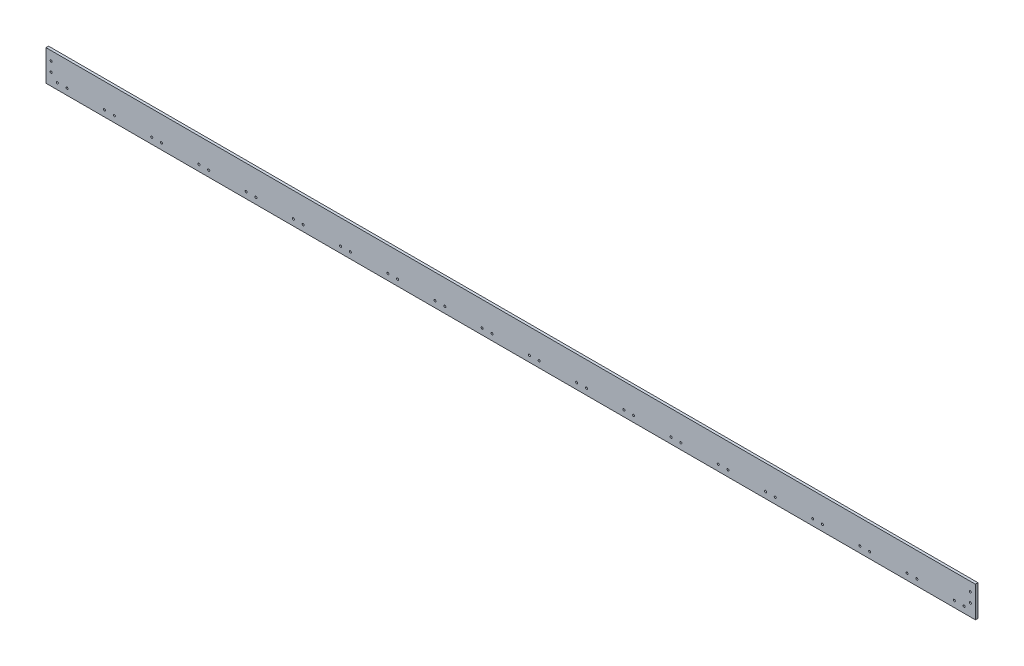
ISO-10303-21;
HEADER;
FILE_DESCRIPTION(('STEP AP214'),'2;1');
FILE_NAME('part.step','',(''),(''),'','','');
FILE_SCHEMA(('AUTOMOTIVE_DESIGN { 1 0 10303 214 1 1 1 1 }'));
ENDSEC;
DATA;
#1=APPLICATION_CONTEXT('core data for automotive mechanical design processes');
#2=APPLICATION_PROTOCOL_DEFINITION('international standard','automotive_design',2000,#1);
#3=PRODUCT_CONTEXT('',#1,'mechanical');
#4=PRODUCT('Part','Part','',(#3));
#5=PRODUCT_RELATED_PRODUCT_CATEGORY('part','',(#4));
#6=PRODUCT_DEFINITION_FORMATION('','',#4);
#7=PRODUCT_DEFINITION_CONTEXT('part definition',#1,'design');
#8=PRODUCT_DEFINITION('design','',#6,#7);
#9=PRODUCT_DEFINITION_SHAPE('','',#8);
#10=(LENGTH_UNIT() NAMED_UNIT(*) SI_UNIT(.MILLI.,.METRE.));
#11=(NAMED_UNIT(*) PLANE_ANGLE_UNIT() SI_UNIT($,.RADIAN.));
#12=(NAMED_UNIT(*) SI_UNIT($,.STERADIAN.) SOLID_ANGLE_UNIT());
#13=UNCERTAINTY_MEASURE_WITH_UNIT(LENGTH_MEASURE(1.E-05),#10,'distance_accuracy_value','');
#14=(GEOMETRIC_REPRESENTATION_CONTEXT(3) GLOBAL_UNCERTAINTY_ASSIGNED_CONTEXT((#13)) GLOBAL_UNIT_ASSIGNED_CONTEXT((#10,
#11,#12)) REPRESENTATION_CONTEXT('',''));
#15=CARTESIAN_POINT('',(0.,0.,0.));
#16=DIRECTION('',(0.,0.,1.));
#17=DIRECTION('',(1.,0.,0.));
#18=AXIS2_PLACEMENT_3D('',#15,#16,#17);
#19=CARTESIAN_POINT('',(0.,0.,6.35));
#20=DIRECTION('',(1.,0.,0.));
#21=DIRECTION('',(0.,1.,0.));
#22=AXIS2_PLACEMENT_3D('',#19,#20,#21);
#23=PLANE('',#22);
#24=DIRECTION('',(0.,-1.,0.));
#25=VECTOR('',#24,1.);
#26=CARTESIAN_POINT('',(0.,0.,0.));
#27=LINE('',#26,#25);
#28=CARTESIAN_POINT('',(0.,76.2,0.));
#29=VERTEX_POINT('',#28);
#30=CARTESIAN_POINT('',(0.,0.,0.));
#31=VERTEX_POINT('',#30);
#32=EDGE_CURVE('E98',#29,#31,#27,.T.);
#33=ORIENTED_EDGE('',*,*,#32,.T.);
#34=DIRECTION('',(0.,0.,-1.));
#35=VECTOR('',#34,1.);
#36=CARTESIAN_POINT('',(0.,0.,6.35));
#37=LINE('',#36,#35);
#38=CARTESIAN_POINT('',(0.,0.,6.35));
#39=VERTEX_POINT('',#38);
#40=EDGE_CURVE('E11',#39,#31,#37,.T.);
#41=ORIENTED_EDGE('',*,*,#40,.F.);
#42=DIRECTION('',(0.,-1.,0.));
#43=VECTOR('',#42,1.);
#44=CARTESIAN_POINT('',(0.,0.,6.35));
#45=LINE('',#44,#43);
#46=CARTESIAN_POINT('',(0.,76.2,6.35));
#47=VERTEX_POINT('',#46);
#48=EDGE_CURVE('E86',#47,#39,#45,.T.);
#49=ORIENTED_EDGE('',*,*,#48,.F.);
#50=DIRECTION('',(0.,0.,-1.));
#51=VECTOR('',#50,1.);
#52=CARTESIAN_POINT('',(0.,76.2,6.35));
#53=LINE('',#52,#51);
#54=EDGE_CURVE('E94',#47,#29,#53,.T.);
#55=ORIENTED_EDGE('',*,*,#54,.T.);
#56=EDGE_LOOP('',(#33,#41,#49,#55));
#57=FACE_BOUND('',#56,.T.);
#58=ADVANCED_FACE('F35',(#57),#23,.F.);
#59=CARTESIAN_POINT('',(0.,0.,6.35));
#60=DIRECTION('',(0.,1.,0.));
#61=DIRECTION('',(0.,0.,1.));
#62=AXIS2_PLACEMENT_3D('',#59,#60,#61);
#63=PLANE('',#62);
#64=DIRECTION('',(1.,0.,0.));
#65=VECTOR('',#64,1.);
#66=CARTESIAN_POINT('',(0.,0.,0.));
#67=LINE('',#66,#65);
#68=CARTESIAN_POINT('',(2292.35,0.,0.));
#69=VERTEX_POINT('',#68);
#70=EDGE_CURVE('E90',#31,#69,#67,.T.);
#71=ORIENTED_EDGE('',*,*,#70,.T.);
#72=DIRECTION('',(0.,0.,-1.));
#73=VECTOR('',#72,1.);
#74=CARTESIAN_POINT('',(2292.35,0.,6.35));
#75=LINE('',#74,#73);
#76=CARTESIAN_POINT('',(2292.35,0.,6.35));
#77=VERTEX_POINT('',#76);
#78=EDGE_CURVE('E43',#77,#69,#75,.T.);
#79=ORIENTED_EDGE('',*,*,#78,.F.);
#80=DIRECTION('',(1.,0.,0.));
#81=VECTOR('',#80,1.);
#82=CARTESIAN_POINT('',(0.,0.,6.35));
#83=LINE('',#82,#81);
#84=EDGE_CURVE('E81',#39,#77,#83,.T.);
#85=ORIENTED_EDGE('',*,*,#84,.F.);
#86=ORIENTED_EDGE('',*,*,#40,.T.);
#87=EDGE_LOOP('',(#71,#79,#85,#86));
#88=FACE_BOUND('',#87,.T.);
#89=ADVANCED_FACE('F89',(#88),#63,.F.);
#90=CARTESIAN_POINT('',(2292.35,0.,6.35));
#91=DIRECTION('',(-1.,0.,0.));
#92=DIRECTION('',(0.,0.,1.));
#93=AXIS2_PLACEMENT_3D('',#90,#91,#92);
#94=PLANE('',#93);
#95=DIRECTION('',(0.,1.,0.));
#96=VECTOR('',#95,1.);
#97=CARTESIAN_POINT('',(2292.35,0.,0.));
#98=LINE('',#97,#96);
#99=CARTESIAN_POINT('',(2292.35,76.2,0.));
#100=VERTEX_POINT('',#99);
#101=EDGE_CURVE('E68',#69,#100,#98,.T.);
#102=ORIENTED_EDGE('',*,*,#101,.T.);
#103=DIRECTION('',(0.,0.,-1.));
#104=VECTOR('',#103,1.);
#105=CARTESIAN_POINT('',(2292.35,76.2,6.35));
#106=LINE('',#105,#104);
#107=CARTESIAN_POINT('',(2292.35,76.2,6.35));
#108=VERTEX_POINT('',#107);
#109=EDGE_CURVE('E91',#108,#100,#106,.T.);
#110=ORIENTED_EDGE('',*,*,#109,.F.);
#111=DIRECTION('',(0.,1.,0.));
#112=VECTOR('',#111,1.);
#113=CARTESIAN_POINT('',(2292.35,0.,6.35));
#114=LINE('',#113,#112);
#115=EDGE_CURVE('E84',#77,#108,#114,.T.);
#116=ORIENTED_EDGE('',*,*,#115,.F.);
#117=ORIENTED_EDGE('',*,*,#78,.T.);
#118=EDGE_LOOP('',(#102,#110,#116,#117));
#119=FACE_BOUND('',#118,.T.);
#120=ADVANCED_FACE('F92',(#119),#94,.F.);
#121=CARTESIAN_POINT('',(0.,76.2,6.35));
#122=DIRECTION('',(0.,-1.,0.));
#123=DIRECTION('',(0.,0.,-1.));
#124=AXIS2_PLACEMENT_3D('',#121,#122,#123);
#125=PLANE('',#124);
#126=DIRECTION('',(-1.,0.,0.));
#127=VECTOR('',#126,1.);
#128=CARTESIAN_POINT('',(0.,76.2,0.));
#129=LINE('',#128,#127);
#130=EDGE_CURVE('E74',#100,#29,#129,.T.);
#131=ORIENTED_EDGE('',*,*,#130,.T.);
#132=ORIENTED_EDGE('',*,*,#54,.F.);
#133=DIRECTION('',(-1.,0.,0.));
#134=VECTOR('',#133,1.);
#135=CARTESIAN_POINT('',(0.,76.2,6.35));
#136=LINE('',#135,#134);
#137=EDGE_CURVE('E51',#108,#47,#136,.T.);
#138=ORIENTED_EDGE('',*,*,#137,.F.);
#139=ORIENTED_EDGE('',*,*,#109,.T.);
#140=EDGE_LOOP('',(#131,#132,#138,#139));
#141=FACE_BOUND('',#140,.T.);
#142=ADVANCED_FACE('F106',(#141),#125,.F.);
#143=CARTESIAN_POINT('',(0.,0.,6.35));
#144=DIRECTION('',(0.,0.,-1.));
#145=DIRECTION('',(-1.,0.,0.));
#146=AXIS2_PLACEMENT_3D('',#143,#144,#145);
#147=PLANE('',#146);
#148=CARTESIAN_POINT('',(1798.65421052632,15.24,6.35));
#149=DIRECTION('',(0.,0.,1.));
#150=DIRECTION('',(1.,0.,0.));
#151=AXIS2_PLACEMENT_3D('',#148,#149,#150);
#152=CIRCLE('',#151,2.54000000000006);
#153=CARTESIAN_POINT('',(1801.19421052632,15.24,6.35));
#154=VERTEX_POINT('',#153);
#155=EDGE_CURVE('E285',#154,#154,#152,.T.);
#156=ORIENTED_EDGE('',*,*,#155,.F.);
#157=EDGE_LOOP('',(#156));
#158=FACE_BOUND('',#157,.T.);
#159=CARTESIAN_POINT('',(1774.52421052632,15.24,6.35));
#160=DIRECTION('',(0.,0.,1.));
#161=DIRECTION('',(1.,0.,0.));
#162=AXIS2_PLACEMENT_3D('',#159,#160,#161);
#163=CIRCLE('',#162,2.54000000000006);
#164=CARTESIAN_POINT('',(1777.06421052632,15.24,6.35));
#165=VERTEX_POINT('',#164);
#166=EDGE_CURVE('E265',#165,#165,#163,.T.);
#167=ORIENTED_EDGE('',*,*,#166,.F.);
#168=EDGE_LOOP('',(#167));
#169=FACE_BOUND('',#168,.T.);
#170=CARTESIAN_POINT('',(2031.53210526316,15.24,6.35));
#171=DIRECTION('',(0.,0.,1.));
#172=DIRECTION('',(1.,0.,0.));
#173=AXIS2_PLACEMENT_3D('',#170,#171,#172);
#174=CIRCLE('',#173,2.54000000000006);
#175=CARTESIAN_POINT('',(2034.07210526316,15.24,6.35));
#176=VERTEX_POINT('',#175);
#177=EDGE_CURVE('E274',#176,#176,#174,.T.);
#178=ORIENTED_EDGE('',*,*,#177,.F.);
#179=EDGE_LOOP('',(#178));
#180=FACE_BOUND('',#179,.T.);
#181=CARTESIAN_POINT('',(1890.96315789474,15.24,6.35));
#182=DIRECTION('',(0.,0.,1.));
#183=DIRECTION('',(1.,0.,0.));
#184=AXIS2_PLACEMENT_3D('',#181,#182,#183);
#185=CIRCLE('',#184,2.54000000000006);
#186=CARTESIAN_POINT('',(1893.50315789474,15.24,6.35));
#187=VERTEX_POINT('',#186);
#188=EDGE_CURVE('E273',#187,#187,#185,.T.);
#189=ORIENTED_EDGE('',*,*,#188,.F.);
#190=EDGE_LOOP('',(#189));
#191=FACE_BOUND('',#190,.T.);
#192=CARTESIAN_POINT('',(1915.09315789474,15.24,6.35));
#193=DIRECTION('',(0.,0.,1.));
#194=DIRECTION('',(1.,0.,0.));
#195=AXIS2_PLACEMENT_3D('',#192,#193,#194);
#196=CIRCLE('',#195,2.54000000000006);
#197=CARTESIAN_POINT('',(1917.63315789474,15.24,6.35));
#198=VERTEX_POINT('',#197);
#199=EDGE_CURVE('E266',#198,#198,#196,.T.);
#200=ORIENTED_EDGE('',*,*,#199,.F.);
#201=EDGE_LOOP('',(#200));
#202=FACE_BOUND('',#201,.T.);
#203=CARTESIAN_POINT('',(2240.28,15.24,6.35));
#204=DIRECTION('',(0.,0.,1.));
#205=DIRECTION('',(1.,0.,0.));
#206=AXIS2_PLACEMENT_3D('',#203,#204,#205);
#207=CIRCLE('',#206,2.54000000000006);
#208=CARTESIAN_POINT('',(2242.82,15.24,6.35));
#209=VERTEX_POINT('',#208);
#210=EDGE_CURVE('E310',#209,#209,#207,.T.);
#211=ORIENTED_EDGE('',*,*,#210,.F.);
#212=EDGE_LOOP('',(#211));
#213=FACE_BOUND('',#212,.T.);
#214=CARTESIAN_POINT('',(2264.41,15.24,6.35));
#215=DIRECTION('',(0.,0.,1.));
#216=DIRECTION('',(1.,0.,0.));
#217=AXIS2_PLACEMENT_3D('',#214,#215,#216);
#218=CIRCLE('',#217,2.54000000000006);
#219=CARTESIAN_POINT('',(2266.95,15.24,6.35));
#220=VERTEX_POINT('',#219);
#221=EDGE_CURVE('E309',#220,#220,#218,.T.);
#222=ORIENTED_EDGE('',*,*,#221,.F.);
#223=EDGE_LOOP('',(#222));
#224=FACE_BOUND('',#223,.T.);
#225=CARTESIAN_POINT('',(2123.84105263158,15.24,6.35));
#226=DIRECTION('',(0.,0.,1.));
#227=DIRECTION('',(1.,0.,0.));
#228=AXIS2_PLACEMENT_3D('',#225,#226,#227);
#229=CIRCLE('',#228,2.54000000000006);
#230=CARTESIAN_POINT('',(2126.38105263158,15.24,6.35));
#231=VERTEX_POINT('',#230);
#232=EDGE_CURVE('E316',#231,#231,#229,.T.);
#233=ORIENTED_EDGE('',*,*,#232,.F.);
#234=EDGE_LOOP('',(#233));
#235=FACE_BOUND('',#234,.T.);
#236=CARTESIAN_POINT('',(2147.97105263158,15.24,6.35));
#237=DIRECTION('',(0.,0.,1.));
#238=DIRECTION('',(1.,0.,0.));
#239=AXIS2_PLACEMENT_3D('',#236,#237,#238);
#240=CIRCLE('',#239,2.54000000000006);
#241=CARTESIAN_POINT('',(2150.51105263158,15.24,6.35));
#242=VERTEX_POINT('',#241);
#243=EDGE_CURVE('E298',#242,#242,#240,.T.);
#244=ORIENTED_EDGE('',*,*,#243,.F.);
#245=EDGE_LOOP('',(#244));
#246=FACE_BOUND('',#245,.T.);
#247=CARTESIAN_POINT('',(2007.40210526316,15.24,6.35));
#248=DIRECTION('',(0.,0.,1.));
#249=DIRECTION('',(1.,0.,0.));
#250=AXIS2_PLACEMENT_3D('',#247,#248,#249);
#251=CIRCLE('',#250,2.54000000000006);
#252=CARTESIAN_POINT('',(2009.94210526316,15.24,6.35));
#253=VERTEX_POINT('',#252);
#254=EDGE_CURVE('E297',#253,#253,#251,.T.);
#255=ORIENTED_EDGE('',*,*,#254,.F.);
#256=EDGE_LOOP('',(#255));
#257=FACE_BOUND('',#256,.T.);
#258=CARTESIAN_POINT('',(1449.33736842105,15.24,6.35));
#259=DIRECTION('',(0.,0.,1.));
#260=DIRECTION('',(1.,0.,0.));
#261=AXIS2_PLACEMENT_3D('',#258,#259,#260);
#262=CIRCLE('',#261,2.54000000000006);
#263=CARTESIAN_POINT('',(1451.87736842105,15.24,6.35));
#264=VERTEX_POINT('',#263);
#265=EDGE_CURVE('E339',#264,#264,#262,.T.);
#266=ORIENTED_EDGE('',*,*,#265,.F.);
#267=EDGE_LOOP('',(#266));
#268=FACE_BOUND('',#267,.T.);
#269=CARTESIAN_POINT('',(1308.76842105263,15.24,6.35));
#270=DIRECTION('',(0.,0.,1.));
#271=DIRECTION('',(1.,0.,0.));
#272=AXIS2_PLACEMENT_3D('',#269,#270,#271);
#273=CIRCLE('',#272,2.54000000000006);
#274=CARTESIAN_POINT('',(1311.30842105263,15.24,6.35));
#275=VERTEX_POINT('',#274);
#276=EDGE_CURVE('E338',#275,#275,#273,.T.);
#277=ORIENTED_EDGE('',*,*,#276,.F.);
#278=EDGE_LOOP('',(#277));
#279=FACE_BOUND('',#278,.T.);
#280=CARTESIAN_POINT('',(1332.89842105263,15.24,6.35));
#281=DIRECTION('',(0.,0.,1.));
#282=DIRECTION('',(1.,0.,0.));
#283=AXIS2_PLACEMENT_3D('',#280,#281,#282);
#284=CIRCLE('',#283,2.54000000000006);
#285=CARTESIAN_POINT('',(1335.43842105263,15.24,6.35));
#286=VERTEX_POINT('',#285);
#287=EDGE_CURVE('E327',#286,#286,#284,.T.);
#288=ORIENTED_EDGE('',*,*,#287,.F.);
#289=EDGE_LOOP('',(#288));
#290=FACE_BOUND('',#289,.T.);
#291=CARTESIAN_POINT('',(1192.32947368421,15.24,6.35));
#292=DIRECTION('',(0.,0.,1.));
#293=DIRECTION('',(1.,0.,0.));
#294=AXIS2_PLACEMENT_3D('',#291,#292,#293);
#295=CIRCLE('',#294,2.54000000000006);
#296=CARTESIAN_POINT('',(1194.86947368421,15.24,6.35));
#297=VERTEX_POINT('',#296);
#298=EDGE_CURVE('E326',#297,#297,#295,.T.);
#299=ORIENTED_EDGE('',*,*,#298,.F.);
#300=EDGE_LOOP('',(#299));
#301=FACE_BOUND('',#300,.T.);
#302=CARTESIAN_POINT('',(1658.08526315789,15.24,6.35));
#303=DIRECTION('',(0.,0.,1.));
#304=DIRECTION('',(1.,0.,0.));
#305=AXIS2_PLACEMENT_3D('',#302,#303,#304);
#306=CIRCLE('',#305,2.54000000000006);
#307=CARTESIAN_POINT('',(1660.62526315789,15.24,6.35));
#308=VERTEX_POINT('',#307);
#309=EDGE_CURVE('E291',#308,#308,#306,.T.);
#310=ORIENTED_EDGE('',*,*,#309,.F.);
#311=EDGE_LOOP('',(#310));
#312=FACE_BOUND('',#311,.T.);
#313=CARTESIAN_POINT('',(1682.21526315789,15.24,6.35));
#314=DIRECTION('',(0.,0.,1.));
#315=DIRECTION('',(1.,0.,0.));
#316=AXIS2_PLACEMENT_3D('',#313,#314,#315);
#317=CIRCLE('',#316,2.54000000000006);
#318=CARTESIAN_POINT('',(1684.75526315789,15.24,6.35));
#319=VERTEX_POINT('',#318);
#320=EDGE_CURVE('E362',#319,#319,#317,.T.);
#321=ORIENTED_EDGE('',*,*,#320,.F.);
#322=EDGE_LOOP('',(#321));
#323=FACE_BOUND('',#322,.T.);
#324=CARTESIAN_POINT('',(1541.64631578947,15.24,6.35));
#325=DIRECTION('',(0.,0.,1.));
#326=DIRECTION('',(1.,0.,0.));
#327=AXIS2_PLACEMENT_3D('',#324,#325,#326);
#328=CIRCLE('',#327,2.54000000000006);
#329=CARTESIAN_POINT('',(1544.18631578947,15.24,6.35));
#330=VERTEX_POINT('',#329);
#331=EDGE_CURVE('E368',#330,#330,#328,.T.);
#332=ORIENTED_EDGE('',*,*,#331,.F.);
#333=EDGE_LOOP('',(#332));
#334=FACE_BOUND('',#333,.T.);
#335=CARTESIAN_POINT('',(1565.77631578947,15.24,6.35));
#336=DIRECTION('',(0.,0.,1.));
#337=DIRECTION('',(1.,0.,0.));
#338=AXIS2_PLACEMENT_3D('',#335,#336,#337);
#339=CIRCLE('',#338,2.54000000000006);
#340=CARTESIAN_POINT('',(1568.31631578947,15.24,6.35));
#341=VERTEX_POINT('',#340);
#342=EDGE_CURVE('E351',#341,#341,#339,.T.);
#343=ORIENTED_EDGE('',*,*,#342,.F.);
#344=EDGE_LOOP('',(#343));
#345=FACE_BOUND('',#344,.T.);
#346=CARTESIAN_POINT('',(1425.20736842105,15.24,6.35));
#347=DIRECTION('',(0.,0.,1.));
#348=DIRECTION('',(1.,0.,0.));
#349=AXIS2_PLACEMENT_3D('',#346,#347,#348);
#350=CIRCLE('',#349,2.54000000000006);
#351=CARTESIAN_POINT('',(1427.74736842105,15.24,6.35));
#352=VERTEX_POINT('',#351);
#353=EDGE_CURVE('E350',#352,#352,#350,.T.);
#354=ORIENTED_EDGE('',*,*,#353,.F.);
#355=EDGE_LOOP('',(#354));
#356=FACE_BOUND('',#355,.T.);
#357=CARTESIAN_POINT('',(1100.02052631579,15.24,6.35));
#358=DIRECTION('',(0.,0.,1.));
#359=DIRECTION('',(1.,0.,0.));
#360=AXIS2_PLACEMENT_3D('',#357,#358,#359);
#361=CIRCLE('',#360,2.54000000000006);
#362=CARTESIAN_POINT('',(1102.56052631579,15.24,6.35));
#363=VERTEX_POINT('',#362);
#364=EDGE_CURVE('E158',#363,#363,#361,.T.);
#365=ORIENTED_EDGE('',*,*,#364,.F.);
#366=EDGE_LOOP('',(#365));
#367=FACE_BOUND('',#366,.T.);
#368=CARTESIAN_POINT('',(1075.89052631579,15.24,6.35));
#369=DIRECTION('',(0.,0.,1.));
#370=DIRECTION('',(1.,0.,0.));
#371=AXIS2_PLACEMENT_3D('',#368,#369,#370);
#372=CIRCLE('',#371,2.54000000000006);
#373=CARTESIAN_POINT('',(1078.43052631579,15.24,6.35));
#374=VERTEX_POINT('',#373);
#375=EDGE_CURVE('E165',#374,#374,#372,.T.);
#376=ORIENTED_EDGE('',*,*,#375,.F.);
#377=EDGE_LOOP('',(#376));
#378=FACE_BOUND('',#377,.T.);
#379=CARTESIAN_POINT('',(1216.45947368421,15.24,6.35));
#380=DIRECTION('',(0.,0.,1.));
#381=DIRECTION('',(1.,0.,0.));
#382=AXIS2_PLACEMENT_3D('',#379,#380,#381);
#383=CIRCLE('',#382,2.54000000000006);
#384=CARTESIAN_POINT('',(1218.99947368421,15.24,6.35));
#385=VERTEX_POINT('',#384);
#386=EDGE_CURVE('E166',#385,#385,#383,.T.);
#387=ORIENTED_EDGE('',*,*,#386,.F.);
#388=EDGE_LOOP('',(#387));
#389=FACE_BOUND('',#388,.T.);
#390=CARTESIAN_POINT('',(959.451578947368,15.24,6.35));
#391=DIRECTION('',(0.,0.,1.));
#392=DIRECTION('',(1.,0.,0.));
#393=AXIS2_PLACEMENT_3D('',#390,#391,#392);
#394=CIRCLE('',#393,2.54000000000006);
#395=CARTESIAN_POINT('',(961.991578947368,15.24,6.35));
#396=VERTEX_POINT('',#395);
#397=EDGE_CURVE('E157',#396,#396,#394,.T.);
#398=ORIENTED_EDGE('',*,*,#397,.F.);
#399=EDGE_LOOP('',(#398));
#400=FACE_BOUND('',#399,.T.);
#401=CARTESIAN_POINT('',(983.581578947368,15.24,6.35));
#402=DIRECTION('',(0.,0.,1.));
#403=DIRECTION('',(1.,0.,0.));
#404=AXIS2_PLACEMENT_3D('',#401,#402,#403);
#405=CIRCLE('',#404,2.54000000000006);
#406=CARTESIAN_POINT('',(986.121578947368,15.24,6.35));
#407=VERTEX_POINT('',#406);
#408=EDGE_CURVE('E177',#407,#407,#405,.T.);
#409=ORIENTED_EDGE('',*,*,#408,.F.);
#410=EDGE_LOOP('',(#409));
#411=FACE_BOUND('',#410,.T.);
#412=CARTESIAN_POINT('',(843.012631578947,15.24,6.35));
#413=DIRECTION('',(0.,0.,1.));
#414=DIRECTION('',(1.,0.,0.));
#415=AXIS2_PLACEMENT_3D('',#412,#413,#414);
#416=CIRCLE('',#415,2.54000000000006);
#417=CARTESIAN_POINT('',(845.552631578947,15.24,6.35));
#418=VERTEX_POINT('',#417);
#419=EDGE_CURVE('E183',#418,#418,#416,.T.);
#420=ORIENTED_EDGE('',*,*,#419,.F.);
#421=EDGE_LOOP('',(#420));
#422=FACE_BOUND('',#421,.T.);
#423=CARTESIAN_POINT('',(867.142631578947,15.24,6.35));
#424=DIRECTION('',(0.,0.,1.));
#425=DIRECTION('',(1.,0.,0.));
#426=AXIS2_PLACEMENT_3D('',#423,#424,#425);
#427=CIRCLE('',#426,2.54000000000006);
#428=CARTESIAN_POINT('',(869.682631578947,15.24,6.35));
#429=VERTEX_POINT('',#428);
#430=EDGE_CURVE('E189',#429,#429,#427,.T.);
#431=ORIENTED_EDGE('',*,*,#430,.F.);
#432=EDGE_LOOP('',(#431));
#433=FACE_BOUND('',#432,.T.);
#434=CARTESIAN_POINT('',(726.573684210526,15.24,6.35));
#435=DIRECTION('',(0.,0.,1.));
#436=DIRECTION('',(1.,0.,0.));
#437=AXIS2_PLACEMENT_3D('',#434,#435,#436);
#438=CIRCLE('',#437,2.54000000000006);
#439=CARTESIAN_POINT('',(729.113684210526,15.24,6.35));
#440=VERTEX_POINT('',#439);
#441=EDGE_CURVE('E195',#440,#440,#438,.T.);
#442=ORIENTED_EDGE('',*,*,#441,.F.);
#443=EDGE_LOOP('',(#442));
#444=FACE_BOUND('',#443,.T.);
#445=CARTESIAN_POINT('',(750.703684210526,15.24,6.35));
#446=DIRECTION('',(0.,0.,1.));
#447=DIRECTION('',(1.,0.,0.));
#448=AXIS2_PLACEMENT_3D('',#445,#446,#447);
#449=CIRCLE('',#448,2.54000000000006);
#450=CARTESIAN_POINT('',(753.243684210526,15.24,6.35));
#451=VERTEX_POINT('',#450);
#452=EDGE_CURVE('E201',#451,#451,#449,.T.);
#453=ORIENTED_EDGE('',*,*,#452,.F.);
#454=EDGE_LOOP('',(#453));
#455=FACE_BOUND('',#454,.T.);
#456=CARTESIAN_POINT('',(401.386842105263,15.24,6.35));
#457=DIRECTION('',(0.,0.,1.));
#458=DIRECTION('',(1.,0.,0.));
#459=AXIS2_PLACEMENT_3D('',#456,#457,#458);
#460=CIRCLE('',#459,2.54000000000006);
#461=CARTESIAN_POINT('',(403.926842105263,15.24,6.35));
#462=VERTEX_POINT('',#461);
#463=EDGE_CURVE('E226',#462,#462,#460,.T.);
#464=ORIENTED_EDGE('',*,*,#463,.F.);
#465=EDGE_LOOP('',(#464));
#466=FACE_BOUND('',#465,.T.);
#467=CARTESIAN_POINT('',(260.817894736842,15.24,6.35));
#468=DIRECTION('',(0.,0.,1.));
#469=DIRECTION('',(1.,0.,0.));
#470=AXIS2_PLACEMENT_3D('',#467,#468,#469);
#471=CIRCLE('',#470,2.54000000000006);
#472=CARTESIAN_POINT('',(263.357894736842,15.24,6.35));
#473=VERTEX_POINT('',#472);
#474=EDGE_CURVE('E225',#473,#473,#471,.T.);
#475=ORIENTED_EDGE('',*,*,#474,.F.);
#476=EDGE_LOOP('',(#475));
#477=FACE_BOUND('',#476,.T.);
#478=CARTESIAN_POINT('',(284.947894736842,15.24,6.35));
#479=DIRECTION('',(0.,0.,1.));
#480=DIRECTION('',(1.,0.,0.));
#481=AXIS2_PLACEMENT_3D('',#478,#479,#480);
#482=CIRCLE('',#481,2.54000000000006);
#483=CARTESIAN_POINT('',(287.487894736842,15.24,6.35));
#484=VERTEX_POINT('',#483);
#485=EDGE_CURVE('E214',#484,#484,#482,.T.);
#486=ORIENTED_EDGE('',*,*,#485,.F.);
#487=EDGE_LOOP('',(#486));
#488=FACE_BOUND('',#487,.T.);
#489=CARTESIAN_POINT('',(144.378947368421,15.24,6.35));
#490=DIRECTION('',(0.,0.,1.));
#491=DIRECTION('',(1.,0.,0.));
#492=AXIS2_PLACEMENT_3D('',#489,#490,#491);
#493=CIRCLE('',#492,2.54000000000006);
#494=CARTESIAN_POINT('',(146.918947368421,15.24,6.35));
#495=VERTEX_POINT('',#494);
#496=EDGE_CURVE('E213',#495,#495,#493,.T.);
#497=ORIENTED_EDGE('',*,*,#496,.F.);
#498=EDGE_LOOP('',(#497));
#499=FACE_BOUND('',#498,.T.);
#500=CARTESIAN_POINT('',(610.134736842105,15.24,6.35));
#501=DIRECTION('',(0.,0.,1.));
#502=DIRECTION('',(1.,0.,0.));
#503=AXIS2_PLACEMENT_3D('',#500,#501,#502);
#504=CIRCLE('',#503,2.54000000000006);
#505=CARTESIAN_POINT('',(612.674736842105,15.24,6.35));
#506=VERTEX_POINT('',#505);
#507=EDGE_CURVE('E207',#506,#506,#504,.T.);
#508=ORIENTED_EDGE('',*,*,#507,.F.);
#509=EDGE_LOOP('',(#508));
#510=FACE_BOUND('',#509,.T.);
#511=CARTESIAN_POINT('',(634.264736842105,15.24,6.35));
#512=DIRECTION('',(0.,0.,1.));
#513=DIRECTION('',(1.,0.,0.));
#514=AXIS2_PLACEMENT_3D('',#511,#512,#513);
#515=CIRCLE('',#514,2.54000000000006);
#516=CARTESIAN_POINT('',(636.804736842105,15.24,6.35));
#517=VERTEX_POINT('',#516);
#518=EDGE_CURVE('E249',#517,#517,#515,.T.);
#519=ORIENTED_EDGE('',*,*,#518,.F.);
#520=EDGE_LOOP('',(#519));
#521=FACE_BOUND('',#520,.T.);
#522=CARTESIAN_POINT('',(493.695789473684,15.24,6.35));
#523=DIRECTION('',(0.,0.,1.));
#524=DIRECTION('',(1.,0.,0.));
#525=AXIS2_PLACEMENT_3D('',#522,#523,#524);
#526=CIRCLE('',#525,2.54000000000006);
#527=CARTESIAN_POINT('',(496.235789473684,15.24,6.35));
#528=VERTEX_POINT('',#527);
#529=EDGE_CURVE('E255',#528,#528,#526,.T.);
#530=ORIENTED_EDGE('',*,*,#529,.F.);
#531=EDGE_LOOP('',(#530));
#532=FACE_BOUND('',#531,.T.);
#533=CARTESIAN_POINT('',(517.825789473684,15.24,6.35));
#534=DIRECTION('',(0.,0.,1.));
#535=DIRECTION('',(1.,0.,0.));
#536=AXIS2_PLACEMENT_3D('',#533,#534,#535);
#537=CIRCLE('',#536,2.54000000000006);
#538=CARTESIAN_POINT('',(520.365789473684,15.24,6.35));
#539=VERTEX_POINT('',#538);
#540=EDGE_CURVE('E238',#539,#539,#537,.T.);
#541=ORIENTED_EDGE('',*,*,#540,.F.);
#542=EDGE_LOOP('',(#541));
#543=FACE_BOUND('',#542,.T.);
#544=CARTESIAN_POINT('',(377.256842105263,15.24,6.35));
#545=DIRECTION('',(0.,0.,1.));
#546=DIRECTION('',(1.,0.,0.));
#547=AXIS2_PLACEMENT_3D('',#544,#545,#546);
#548=CIRCLE('',#547,2.54000000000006);
#549=CARTESIAN_POINT('',(379.796842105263,15.24,6.35));
#550=VERTEX_POINT('',#549);
#551=EDGE_CURVE('E237',#550,#550,#548,.T.);
#552=ORIENTED_EDGE('',*,*,#551,.F.);
#553=EDGE_LOOP('',(#552));
#554=FACE_BOUND('',#553,.T.);
#555=CARTESIAN_POINT('',(168.508947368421,15.24,6.35));
#556=DIRECTION('',(0.,0.,1.));
#557=DIRECTION('',(1.,0.,0.));
#558=AXIS2_PLACEMENT_3D('',#555,#556,#557);
#559=CIRCLE('',#558,2.54000000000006);
#560=CARTESIAN_POINT('',(171.048947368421,15.24,6.35));
#561=VERTEX_POINT('',#560);
#562=EDGE_CURVE('E150',#561,#561,#559,.T.);
#563=ORIENTED_EDGE('',*,*,#562,.F.);
#564=EDGE_LOOP('',(#563));
#565=FACE_BOUND('',#564,.T.);
#566=CARTESIAN_POINT('',(12.7,53.975,6.35));
#567=DIRECTION('',(0.,0.,1.));
#568=DIRECTION('',(1.,0.,0.));
#569=AXIS2_PLACEMENT_3D('',#566,#567,#568);
#570=CIRCLE('',#569,2.54);
#571=CARTESIAN_POINT('',(15.24,53.975,6.35));
#572=VERTEX_POINT('',#571);
#573=EDGE_CURVE('E141',#572,#572,#570,.T.);
#574=ORIENTED_EDGE('',*,*,#573,.F.);
#575=EDGE_LOOP('',(#574));
#576=FACE_BOUND('',#575,.T.);
#577=CARTESIAN_POINT('',(2279.65,29.8450000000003,6.35));
#578=DIRECTION('',(0.,0.,1.));
#579=DIRECTION('',(-1.,0.,0.));
#580=AXIS2_PLACEMENT_3D('',#577,#578,#579);
#581=CIRCLE('',#580,2.54000000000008);
#582=CARTESIAN_POINT('',(2277.11,29.8450000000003,6.35));
#583=VERTEX_POINT('',#582);
#584=EDGE_CURVE('E133',#583,#583,#581,.T.);
#585=ORIENTED_EDGE('',*,*,#584,.F.);
#586=EDGE_LOOP('',(#585));
#587=FACE_BOUND('',#586,.T.);
#588=CARTESIAN_POINT('',(2279.65,53.9750000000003,6.35));
#589=DIRECTION('',(0.,0.,1.));
#590=DIRECTION('',(-1.,0.,0.));
#591=AXIS2_PLACEMENT_3D('',#588,#589,#590);
#592=CIRCLE('',#591,2.54000000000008);
#593=CARTESIAN_POINT('',(2277.11,53.9750000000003,6.35));
#594=VERTEX_POINT('',#593);
#595=EDGE_CURVE('E134',#594,#594,#592,.T.);
#596=ORIENTED_EDGE('',*,*,#595,.F.);
#597=EDGE_LOOP('',(#596));
#598=FACE_BOUND('',#597,.T.);
#599=CARTESIAN_POINT('',(12.7,29.845,6.35));
#600=DIRECTION('',(0.,0.,1.));
#601=DIRECTION('',(1.,0.,0.));
#602=AXIS2_PLACEMENT_3D('',#599,#600,#601);
#603=CIRCLE('',#602,2.54);
#604=CARTESIAN_POINT('',(15.24,29.845,6.35));
#605=VERTEX_POINT('',#604);
#606=EDGE_CURVE('E126',#605,#605,#603,.T.);
#607=ORIENTED_EDGE('',*,*,#606,.F.);
#608=EDGE_LOOP('',(#607));
#609=FACE_BOUND('',#608,.T.);
#610=CARTESIAN_POINT('',(27.94,15.24,6.35));
#611=DIRECTION('',(0.,0.,1.));
#612=DIRECTION('',(1.,0.,0.));
#613=AXIS2_PLACEMENT_3D('',#610,#611,#612);
#614=CIRCLE('',#613,2.54000000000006);
#615=CARTESIAN_POINT('',(30.48,15.24,6.35));
#616=VERTEX_POINT('',#615);
#617=EDGE_CURVE('E117',#616,#616,#614,.T.);
#618=ORIENTED_EDGE('',*,*,#617,.F.);
#619=EDGE_LOOP('',(#618));
#620=FACE_BOUND('',#619,.T.);
#621=CARTESIAN_POINT('',(52.07,15.24,6.35));
#622=DIRECTION('',(0.,0.,1.));
#623=DIRECTION('',(1.,0.,0.));
#624=AXIS2_PLACEMENT_3D('',#621,#622,#623);
#625=CIRCLE('',#624,2.54000000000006);
#626=CARTESIAN_POINT('',(54.6100000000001,15.24,6.35));
#627=VERTEX_POINT('',#626);
#628=EDGE_CURVE('E114',#627,#627,#625,.T.);
#629=ORIENTED_EDGE('',*,*,#628,.F.);
#630=EDGE_LOOP('',(#629));
#631=FACE_BOUND('',#630,.T.);
#632=ORIENTED_EDGE('',*,*,#48,.T.);
#633=ORIENTED_EDGE('',*,*,#84,.T.);
#634=ORIENTED_EDGE('',*,*,#115,.T.);
#635=ORIENTED_EDGE('',*,*,#137,.T.);
#636=EDGE_LOOP('',(#632,#633,#634,#635));
#637=FACE_BOUND('',#636,.T.);
#638=ADVANCED_FACE('F82',(#158,#169,#180,#191,#202,#213,#224,#235,#246,#257,#268,#279,#290,#301,
#312,#323,#334,#345,#356,#367,#378,#389,#400,#411,#422,#433,#444,#455,#466,#477,#488,#499,#510,
#521,#532,#543,#554,#565,#576,#587,#598,#609,#620,#631,#637),#147,.F.);
#639=CARTESIAN_POINT('',(0.,0.,0.));
#640=DIRECTION('',(0.,0.,-1.));
#641=DIRECTION('',(-1.,0.,0.));
#642=AXIS2_PLACEMENT_3D('',#639,#640,#641);
#643=PLANE('',#642);
#644=CARTESIAN_POINT('',(1798.65421052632,15.24,0.));
#645=DIRECTION('',(0.,0.,-1.));
#646=DIRECTION('',(-1.,0.,0.));
#647=AXIS2_PLACEMENT_3D('',#644,#645,#646);
#648=CIRCLE('',#647,2.54000000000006);
#649=CARTESIAN_POINT('',(1796.11421052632,15.24,0.));
#650=VERTEX_POINT('',#649);
#651=EDGE_CURVE('E288',#650,#650,#648,.F.);
#652=ORIENTED_EDGE('',*,*,#651,.T.);
#653=EDGE_LOOP('',(#652));
#654=FACE_BOUND('',#653,.T.);
#655=CARTESIAN_POINT('',(1774.52421052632,15.24,0.));
#656=DIRECTION('',(0.,0.,-1.));
#657=DIRECTION('',(-1.,0.,0.));
#658=AXIS2_PLACEMENT_3D('',#655,#656,#657);
#659=CIRCLE('',#658,2.54000000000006);
#660=CARTESIAN_POINT('',(1771.98421052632,15.24,0.));
#661=VERTEX_POINT('',#660);
#662=EDGE_CURVE('E282',#661,#661,#659,.F.);
#663=ORIENTED_EDGE('',*,*,#662,.T.);
#664=EDGE_LOOP('',(#663));
#665=FACE_BOUND('',#664,.T.);
#666=CARTESIAN_POINT('',(2031.53210526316,15.24,0.));
#667=DIRECTION('',(0.,0.,-1.));
#668=DIRECTION('',(-1.,0.,0.));
#669=AXIS2_PLACEMENT_3D('',#666,#667,#668);
#670=CIRCLE('',#669,2.54000000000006);
#671=CARTESIAN_POINT('',(2028.99210526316,15.24,0.));
#672=VERTEX_POINT('',#671);
#673=EDGE_CURVE('E270',#672,#672,#670,.F.);
#674=ORIENTED_EDGE('',*,*,#673,.T.);
#675=EDGE_LOOP('',(#674));
#676=FACE_BOUND('',#675,.T.);
#677=CARTESIAN_POINT('',(1890.96315789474,15.24,0.));
#678=DIRECTION('',(0.,0.,-1.));
#679=DIRECTION('',(-1.,0.,0.));
#680=AXIS2_PLACEMENT_3D('',#677,#678,#679);
#681=CIRCLE('',#680,2.54000000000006);
#682=CARTESIAN_POINT('',(1888.42315789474,15.24,0.));
#683=VERTEX_POINT('',#682);
#684=EDGE_CURVE('E269',#683,#683,#681,.F.);
#685=ORIENTED_EDGE('',*,*,#684,.T.);
#686=EDGE_LOOP('',(#685));
#687=FACE_BOUND('',#686,.T.);
#688=CARTESIAN_POINT('',(1915.09315789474,15.24,0.));
#689=DIRECTION('',(0.,0.,-1.));
#690=DIRECTION('',(-1.,0.,0.));
#691=AXIS2_PLACEMENT_3D('',#688,#689,#690);
#692=CIRCLE('',#691,2.54000000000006);
#693=CARTESIAN_POINT('',(1912.55315789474,15.24,0.));
#694=VERTEX_POINT('',#693);
#695=EDGE_CURVE('E262',#694,#694,#692,.F.);
#696=ORIENTED_EDGE('',*,*,#695,.T.);
#697=EDGE_LOOP('',(#696));
#698=FACE_BOUND('',#697,.T.);
#699=CARTESIAN_POINT('',(2240.28,15.24,0.));
#700=DIRECTION('',(0.,0.,-1.));
#701=DIRECTION('',(-1.,0.,0.));
#702=AXIS2_PLACEMENT_3D('',#699,#700,#701);
#703=CIRCLE('',#702,2.54000000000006);
#704=CARTESIAN_POINT('',(2237.74,15.24,0.));
#705=VERTEX_POINT('',#704);
#706=EDGE_CURVE('E306',#705,#705,#703,.F.);
#707=ORIENTED_EDGE('',*,*,#706,.T.);
#708=EDGE_LOOP('',(#707));
#709=FACE_BOUND('',#708,.T.);
#710=CARTESIAN_POINT('',(2264.41,15.24,0.));
#711=DIRECTION('',(0.,0.,-1.));
#712=DIRECTION('',(-1.,0.,0.));
#713=AXIS2_PLACEMENT_3D('',#710,#711,#712);
#714=CIRCLE('',#713,2.54000000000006);
#715=CARTESIAN_POINT('',(2261.87,15.24,0.));
#716=VERTEX_POINT('',#715);
#717=EDGE_CURVE('E313',#716,#716,#714,.F.);
#718=ORIENTED_EDGE('',*,*,#717,.T.);
#719=EDGE_LOOP('',(#718));
#720=FACE_BOUND('',#719,.T.);
#721=CARTESIAN_POINT('',(2123.84105263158,15.24,0.));
#722=DIRECTION('',(0.,0.,-1.));
#723=DIRECTION('',(-1.,0.,0.));
#724=AXIS2_PLACEMENT_3D('',#721,#722,#723);
#725=CIRCLE('',#724,2.54000000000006);
#726=CARTESIAN_POINT('',(2121.30105263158,15.24,0.));
#727=VERTEX_POINT('',#726);
#728=EDGE_CURVE('E301',#727,#727,#725,.F.);
#729=ORIENTED_EDGE('',*,*,#728,.T.);
#730=EDGE_LOOP('',(#729));
#731=FACE_BOUND('',#730,.T.);
#732=CARTESIAN_POINT('',(2147.97105263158,15.24,0.));
#733=DIRECTION('',(0.,0.,-1.));
#734=DIRECTION('',(-1.,0.,0.));
#735=AXIS2_PLACEMENT_3D('',#732,#733,#734);
#736=CIRCLE('',#735,2.54000000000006);
#737=CARTESIAN_POINT('',(2145.43105263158,15.24,0.));
#738=VERTEX_POINT('',#737);
#739=EDGE_CURVE('E294',#738,#738,#736,.F.);
#740=ORIENTED_EDGE('',*,*,#739,.T.);
#741=EDGE_LOOP('',(#740));
#742=FACE_BOUND('',#741,.T.);
#743=CARTESIAN_POINT('',(2007.40210526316,15.24,0.));
#744=DIRECTION('',(0.,0.,-1.));
#745=DIRECTION('',(-1.,0.,0.));
#746=AXIS2_PLACEMENT_3D('',#743,#744,#745);
#747=CIRCLE('',#746,2.54000000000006);
#748=CARTESIAN_POINT('',(2004.86210526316,15.24,0.));
#749=VERTEX_POINT('',#748);
#750=EDGE_CURVE('E277',#749,#749,#747,.F.);
#751=ORIENTED_EDGE('',*,*,#750,.T.);
#752=EDGE_LOOP('',(#751));
#753=FACE_BOUND('',#752,.T.);
#754=CARTESIAN_POINT('',(1449.33736842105,15.24,0.));
#755=DIRECTION('',(0.,0.,-1.));
#756=DIRECTION('',(-1.,0.,0.));
#757=AXIS2_PLACEMENT_3D('',#754,#755,#756);
#758=CIRCLE('',#757,2.54000000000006);
#759=CARTESIAN_POINT('',(1446.79736842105,15.24,0.));
#760=VERTEX_POINT('',#759);
#761=EDGE_CURVE('E335',#760,#760,#758,.F.);
#762=ORIENTED_EDGE('',*,*,#761,.T.);
#763=EDGE_LOOP('',(#762));
#764=FACE_BOUND('',#763,.T.);
#765=CARTESIAN_POINT('',(1308.76842105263,15.24,0.));
#766=DIRECTION('',(0.,0.,-1.));
#767=DIRECTION('',(-1.,0.,0.));
#768=AXIS2_PLACEMENT_3D('',#765,#766,#767);
#769=CIRCLE('',#768,2.54000000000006);
#770=CARTESIAN_POINT('',(1306.22842105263,15.24,0.));
#771=VERTEX_POINT('',#770);
#772=EDGE_CURVE('E330',#771,#771,#769,.F.);
#773=ORIENTED_EDGE('',*,*,#772,.T.);
#774=EDGE_LOOP('',(#773));
#775=FACE_BOUND('',#774,.T.);
#776=CARTESIAN_POINT('',(1332.89842105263,15.24,0.));
#777=DIRECTION('',(0.,0.,-1.));
#778=DIRECTION('',(-1.,0.,0.));
#779=AXIS2_PLACEMENT_3D('',#776,#777,#778);
#780=CIRCLE('',#779,2.54000000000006);
#781=CARTESIAN_POINT('',(1330.35842105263,15.24,0.));
#782=VERTEX_POINT('',#781);
#783=EDGE_CURVE('E323',#782,#782,#780,.F.);
#784=ORIENTED_EDGE('',*,*,#783,.T.);
#785=EDGE_LOOP('',(#784));
#786=FACE_BOUND('',#785,.T.);
#787=CARTESIAN_POINT('',(1192.32947368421,15.24,0.));
#788=DIRECTION('',(0.,0.,-1.));
#789=DIRECTION('',(-1.,0.,0.));
#790=AXIS2_PLACEMENT_3D('',#787,#788,#789);
#791=CIRCLE('',#790,2.54000000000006);
#792=CARTESIAN_POINT('',(1189.78947368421,15.24,0.));
#793=VERTEX_POINT('',#792);
#794=EDGE_CURVE('E169',#793,#793,#791,.F.);
#795=ORIENTED_EDGE('',*,*,#794,.T.);
#796=EDGE_LOOP('',(#795));
#797=FACE_BOUND('',#796,.T.);
#798=CARTESIAN_POINT('',(1658.08526315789,15.24,0.));
#799=DIRECTION('',(0.,0.,-1.));
#800=DIRECTION('',(-1.,0.,0.));
#801=AXIS2_PLACEMENT_3D('',#798,#799,#800);
#802=CIRCLE('',#801,2.54000000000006);
#803=CARTESIAN_POINT('',(1655.54526315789,15.24,0.));
#804=VERTEX_POINT('',#803);
#805=EDGE_CURVE('E359',#804,#804,#802,.F.);
#806=ORIENTED_EDGE('',*,*,#805,.T.);
#807=EDGE_LOOP('',(#806));
#808=FACE_BOUND('',#807,.T.);
#809=CARTESIAN_POINT('',(1682.21526315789,15.24,0.));
#810=DIRECTION('',(0.,0.,-1.));
#811=DIRECTION('',(-1.,0.,0.));
#812=AXIS2_PLACEMENT_3D('',#809,#810,#811);
#813=CIRCLE('',#812,2.54000000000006);
#814=CARTESIAN_POINT('',(1679.67526315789,15.24,0.));
#815=VERTEX_POINT('',#814);
#816=EDGE_CURVE('E365',#815,#815,#813,.F.);
#817=ORIENTED_EDGE('',*,*,#816,.T.);
#818=EDGE_LOOP('',(#817));
#819=FACE_BOUND('',#818,.T.);
#820=CARTESIAN_POINT('',(1541.64631578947,15.24,0.));
#821=DIRECTION('',(0.,0.,-1.));
#822=DIRECTION('',(-1.,0.,0.));
#823=AXIS2_PLACEMENT_3D('',#820,#821,#822);
#824=CIRCLE('',#823,2.54000000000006);
#825=CARTESIAN_POINT('',(1539.10631578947,15.24,0.));
#826=VERTEX_POINT('',#825);
#827=EDGE_CURVE('E354',#826,#826,#824,.F.);
#828=ORIENTED_EDGE('',*,*,#827,.T.);
#829=EDGE_LOOP('',(#828));
#830=FACE_BOUND('',#829,.T.);
#831=CARTESIAN_POINT('',(1565.77631578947,15.24,0.));
#832=DIRECTION('',(0.,0.,-1.));
#833=DIRECTION('',(-1.,0.,0.));
#834=AXIS2_PLACEMENT_3D('',#831,#832,#833);
#835=CIRCLE('',#834,2.54000000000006);
#836=CARTESIAN_POINT('',(1563.23631578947,15.24,0.));
#837=VERTEX_POINT('',#836);
#838=EDGE_CURVE('E347',#837,#837,#835,.F.);
#839=ORIENTED_EDGE('',*,*,#838,.T.);
#840=EDGE_LOOP('',(#839));
#841=FACE_BOUND('',#840,.T.);
#842=CARTESIAN_POINT('',(1425.20736842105,15.24,0.));
#843=DIRECTION('',(0.,0.,-1.));
#844=DIRECTION('',(-1.,0.,0.));
#845=AXIS2_PLACEMENT_3D('',#842,#843,#844);
#846=CIRCLE('',#845,2.54000000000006);
#847=CARTESIAN_POINT('',(1422.66736842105,15.24,0.));
#848=VERTEX_POINT('',#847);
#849=EDGE_CURVE('E342',#848,#848,#846,.F.);
#850=ORIENTED_EDGE('',*,*,#849,.T.);
#851=EDGE_LOOP('',(#850));
#852=FACE_BOUND('',#851,.T.);
#853=CARTESIAN_POINT('',(1100.02052631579,15.24,0.));
#854=DIRECTION('',(0.,0.,-1.));
#855=DIRECTION('',(-1.,0.,0.));
#856=AXIS2_PLACEMENT_3D('',#853,#854,#855);
#857=CIRCLE('',#856,2.54000000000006);
#858=CARTESIAN_POINT('',(1097.48052631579,15.24,0.));
#859=VERTEX_POINT('',#858);
#860=EDGE_CURVE('E154',#859,#859,#857,.F.);
#861=ORIENTED_EDGE('',*,*,#860,.T.);
#862=EDGE_LOOP('',(#861));
#863=FACE_BOUND('',#862,.T.);
#864=CARTESIAN_POINT('',(1075.89052631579,15.24,0.));
#865=DIRECTION('',(0.,0.,-1.));
#866=DIRECTION('',(-1.,0.,0.));
#867=AXIS2_PLACEMENT_3D('',#864,#865,#866);
#868=CIRCLE('',#867,2.54000000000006);
#869=CARTESIAN_POINT('',(1073.35052631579,15.24,0.));
#870=VERTEX_POINT('',#869);
#871=EDGE_CURVE('E161',#870,#870,#868,.F.);
#872=ORIENTED_EDGE('',*,*,#871,.T.);
#873=EDGE_LOOP('',(#872));
#874=FACE_BOUND('',#873,.T.);
#875=CARTESIAN_POINT('',(1216.45947368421,15.24,0.));
#876=DIRECTION('',(0.,0.,-1.));
#877=DIRECTION('',(-1.,0.,0.));
#878=AXIS2_PLACEMENT_3D('',#875,#876,#877);
#879=CIRCLE('',#878,2.54000000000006);
#880=CARTESIAN_POINT('',(1213.91947368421,15.24,0.));
#881=VERTEX_POINT('',#880);
#882=EDGE_CURVE('E162',#881,#881,#879,.F.);
#883=ORIENTED_EDGE('',*,*,#882,.T.);
#884=EDGE_LOOP('',(#883));
#885=FACE_BOUND('',#884,.T.);
#886=CARTESIAN_POINT('',(959.451578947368,15.24,0.));
#887=DIRECTION('',(0.,0.,-1.));
#888=DIRECTION('',(-1.,0.,0.));
#889=AXIS2_PLACEMENT_3D('',#886,#887,#888);
#890=CIRCLE('',#889,2.54000000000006);
#891=CARTESIAN_POINT('',(956.911578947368,15.24,0.));
#892=VERTEX_POINT('',#891);
#893=EDGE_CURVE('E174',#892,#892,#890,.F.);
#894=ORIENTED_EDGE('',*,*,#893,.T.);
#895=EDGE_LOOP('',(#894));
#896=FACE_BOUND('',#895,.T.);
#897=CARTESIAN_POINT('',(983.581578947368,15.24,0.));
#898=DIRECTION('',(0.,0.,-1.));
#899=DIRECTION('',(-1.,0.,0.));
#900=AXIS2_PLACEMENT_3D('',#897,#898,#899);
#901=CIRCLE('',#900,2.54000000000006);
#902=CARTESIAN_POINT('',(981.041578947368,15.24,0.));
#903=VERTEX_POINT('',#902);
#904=EDGE_CURVE('E180',#903,#903,#901,.F.);
#905=ORIENTED_EDGE('',*,*,#904,.T.);
#906=EDGE_LOOP('',(#905));
#907=FACE_BOUND('',#906,.T.);
#908=CARTESIAN_POINT('',(843.012631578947,15.24,0.));
#909=DIRECTION('',(0.,0.,-1.));
#910=DIRECTION('',(-1.,0.,0.));
#911=AXIS2_PLACEMENT_3D('',#908,#909,#910);
#912=CIRCLE('',#911,2.54000000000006);
#913=CARTESIAN_POINT('',(840.472631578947,15.24,0.));
#914=VERTEX_POINT('',#913);
#915=EDGE_CURVE('E186',#914,#914,#912,.F.);
#916=ORIENTED_EDGE('',*,*,#915,.T.);
#917=EDGE_LOOP('',(#916));
#918=FACE_BOUND('',#917,.T.);
#919=CARTESIAN_POINT('',(867.142631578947,15.24,0.));
#920=DIRECTION('',(0.,0.,-1.));
#921=DIRECTION('',(-1.,0.,0.));
#922=AXIS2_PLACEMENT_3D('',#919,#920,#921);
#923=CIRCLE('',#922,2.54000000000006);
#924=CARTESIAN_POINT('',(864.602631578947,15.24,0.));
#925=VERTEX_POINT('',#924);
#926=EDGE_CURVE('E192',#925,#925,#923,.F.);
#927=ORIENTED_EDGE('',*,*,#926,.T.);
#928=EDGE_LOOP('',(#927));
#929=FACE_BOUND('',#928,.T.);
#930=CARTESIAN_POINT('',(726.573684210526,15.24,0.));
#931=DIRECTION('',(0.,0.,-1.));
#932=DIRECTION('',(-1.,0.,0.));
#933=AXIS2_PLACEMENT_3D('',#930,#931,#932);
#934=CIRCLE('',#933,2.54000000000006);
#935=CARTESIAN_POINT('',(724.033684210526,15.24,0.));
#936=VERTEX_POINT('',#935);
#937=EDGE_CURVE('E198',#936,#936,#934,.F.);
#938=ORIENTED_EDGE('',*,*,#937,.T.);
#939=EDGE_LOOP('',(#938));
#940=FACE_BOUND('',#939,.T.);
#941=CARTESIAN_POINT('',(750.703684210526,15.24,0.));
#942=DIRECTION('',(0.,0.,-1.));
#943=DIRECTION('',(-1.,0.,0.));
#944=AXIS2_PLACEMENT_3D('',#941,#942,#943);
#945=CIRCLE('',#944,2.54000000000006);
#946=CARTESIAN_POINT('',(748.163684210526,15.24,0.));
#947=VERTEX_POINT('',#946);
#948=EDGE_CURVE('E204',#947,#947,#945,.F.);
#949=ORIENTED_EDGE('',*,*,#948,.T.);
#950=EDGE_LOOP('',(#949));
#951=FACE_BOUND('',#950,.T.);
#952=CARTESIAN_POINT('',(401.386842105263,15.24,0.));
#953=DIRECTION('',(0.,0.,-1.));
#954=DIRECTION('',(-1.,0.,0.));
#955=AXIS2_PLACEMENT_3D('',#952,#953,#954);
#956=CIRCLE('',#955,2.54000000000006);
#957=CARTESIAN_POINT('',(403.926842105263,15.24,0.));
#958=VERTEX_POINT('',#957);
#959=EDGE_CURVE('E222',#958,#958,#956,.F.);
#960=ORIENTED_EDGE('',*,*,#959,.T.);
#961=EDGE_LOOP('',(#960));
#962=FACE_BOUND('',#961,.T.);
#963=CARTESIAN_POINT('',(260.817894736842,15.24,0.));
#964=DIRECTION('',(0.,0.,-1.));
#965=DIRECTION('',(-1.,0.,0.));
#966=AXIS2_PLACEMENT_3D('',#963,#964,#965);
#967=CIRCLE('',#966,2.54000000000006);
#968=CARTESIAN_POINT('',(263.357894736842,15.24,0.));
#969=VERTEX_POINT('',#968);
#970=EDGE_CURVE('E217',#969,#969,#967,.F.);
#971=ORIENTED_EDGE('',*,*,#970,.T.);
#972=EDGE_LOOP('',(#971));
#973=FACE_BOUND('',#972,.T.);
#974=CARTESIAN_POINT('',(284.947894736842,15.24,0.));
#975=DIRECTION('',(0.,0.,-1.));
#976=DIRECTION('',(-1.,0.,0.));
#977=AXIS2_PLACEMENT_3D('',#974,#975,#976);
#978=CIRCLE('',#977,2.54000000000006);
#979=CARTESIAN_POINT('',(287.487894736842,15.24,0.));
#980=VERTEX_POINT('',#979);
#981=EDGE_CURVE('E210',#980,#980,#978,.F.);
#982=ORIENTED_EDGE('',*,*,#981,.T.);
#983=EDGE_LOOP('',(#982));
#984=FACE_BOUND('',#983,.T.);
#985=CARTESIAN_POINT('',(144.378947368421,15.24,0.));
#986=DIRECTION('',(0.,0.,-1.));
#987=DIRECTION('',(-1.,0.,0.));
#988=AXIS2_PLACEMENT_3D('',#985,#986,#987);
#989=CIRCLE('',#988,2.54000000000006);
#990=CARTESIAN_POINT('',(141.838947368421,15.24,0.));
#991=VERTEX_POINT('',#990);
#992=EDGE_CURVE('E153',#991,#991,#989,.F.);
#993=ORIENTED_EDGE('',*,*,#992,.T.);
#994=EDGE_LOOP('',(#993));
#995=FACE_BOUND('',#994,.T.);
#996=CARTESIAN_POINT('',(610.134736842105,15.24,0.));
#997=DIRECTION('',(0.,0.,-1.));
#998=DIRECTION('',(-1.,0.,0.));
#999=AXIS2_PLACEMENT_3D('',#996,#997,#998);
#1000=CIRCLE('',#999,2.54000000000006);
#1001=CARTESIAN_POINT('',(607.594736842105,15.24,0.));
#1002=VERTEX_POINT('',#1001);
#1003=EDGE_CURVE('E246',#1002,#1002,#1000,.F.);
#1004=ORIENTED_EDGE('',*,*,#1003,.T.);
#1005=EDGE_LOOP('',(#1004));
#1006=FACE_BOUND('',#1005,.T.);
#1007=CARTESIAN_POINT('',(634.264736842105,15.24,0.));
#1008=DIRECTION('',(0.,0.,-1.));
#1009=DIRECTION('',(-1.,0.,0.));
#1010=AXIS2_PLACEMENT_3D('',#1007,#1008,#1009);
#1011=CIRCLE('',#1010,2.54000000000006);
#1012=CARTESIAN_POINT('',(631.724736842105,15.24,0.));
#1013=VERTEX_POINT('',#1012);
#1014=EDGE_CURVE('E252',#1013,#1013,#1011,.F.);
#1015=ORIENTED_EDGE('',*,*,#1014,.T.);
#1016=EDGE_LOOP('',(#1015));
#1017=FACE_BOUND('',#1016,.T.);
#1018=CARTESIAN_POINT('',(493.695789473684,15.24,0.));
#1019=DIRECTION('',(0.,0.,-1.));
#1020=DIRECTION('',(-1.,0.,0.));
#1021=AXIS2_PLACEMENT_3D('',#1018,#1019,#1020);
#1022=CIRCLE('',#1021,2.54000000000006);
#1023=CARTESIAN_POINT('',(491.155789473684,15.24,0.));
#1024=VERTEX_POINT('',#1023);
#1025=EDGE_CURVE('E241',#1024,#1024,#1022,.F.);
#1026=ORIENTED_EDGE('',*,*,#1025,.T.);
#1027=EDGE_LOOP('',(#1026));
#1028=FACE_BOUND('',#1027,.T.);
#1029=CARTESIAN_POINT('',(517.825789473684,15.24,0.));
#1030=DIRECTION('',(0.,0.,-1.));
#1031=DIRECTION('',(-1.,0.,0.));
#1032=AXIS2_PLACEMENT_3D('',#1029,#1030,#1031);
#1033=CIRCLE('',#1032,2.54000000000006);
#1034=CARTESIAN_POINT('',(515.285789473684,15.24,0.));
#1035=VERTEX_POINT('',#1034);
#1036=EDGE_CURVE('E234',#1035,#1035,#1033,.F.);
#1037=ORIENTED_EDGE('',*,*,#1036,.T.);
#1038=EDGE_LOOP('',(#1037));
#1039=FACE_BOUND('',#1038,.T.);
#1040=CARTESIAN_POINT('',(377.256842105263,15.24,0.));
#1041=DIRECTION('',(0.,0.,-1.));
#1042=DIRECTION('',(-1.,0.,0.));
#1043=AXIS2_PLACEMENT_3D('',#1040,#1041,#1042);
#1044=CIRCLE('',#1043,2.54000000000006);
#1045=CARTESIAN_POINT('',(379.796842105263,15.24,0.));
#1046=VERTEX_POINT('',#1045);
#1047=EDGE_CURVE('E229',#1046,#1046,#1044,.F.);
#1048=ORIENTED_EDGE('',*,*,#1047,.T.);
#1049=EDGE_LOOP('',(#1048));
#1050=FACE_BOUND('',#1049,.T.);
#1051=CARTESIAN_POINT('',(168.508947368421,15.24,0.));
#1052=DIRECTION('',(0.,0.,-1.));
#1053=DIRECTION('',(-1.,0.,0.));
#1054=AXIS2_PLACEMENT_3D('',#1051,#1052,#1053);
#1055=CIRCLE('',#1054,2.54000000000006);
#1056=CARTESIAN_POINT('',(165.968947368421,15.24,0.));
#1057=VERTEX_POINT('',#1056);
#1058=EDGE_CURVE('E137',#1057,#1057,#1055,.F.);
#1059=ORIENTED_EDGE('',*,*,#1058,.T.);
#1060=EDGE_LOOP('',(#1059));
#1061=FACE_BOUND('',#1060,.T.);
#1062=CARTESIAN_POINT('',(12.7,53.975,0.));
#1063=DIRECTION('',(0.,0.,-1.));
#1064=DIRECTION('',(-1.,0.,0.));
#1065=AXIS2_PLACEMENT_3D('',#1062,#1063,#1064);
#1066=CIRCLE('',#1065,2.54);
#1067=CARTESIAN_POINT('',(10.16,53.975,0.));
#1068=VERTEX_POINT('',#1067);
#1069=EDGE_CURVE('E129',#1068,#1068,#1066,.F.);
#1070=ORIENTED_EDGE('',*,*,#1069,.T.);
#1071=EDGE_LOOP('',(#1070));
#1072=FACE_BOUND('',#1071,.T.);
#1073=CARTESIAN_POINT('',(2279.65,29.8450000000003,0.));
#1074=DIRECTION('',(0.,0.,-1.));
#1075=DIRECTION('',(-1.,0.,0.));
#1076=AXIS2_PLACEMENT_3D('',#1073,#1074,#1075);
#1077=CIRCLE('',#1076,2.54000000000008);
#1078=CARTESIAN_POINT('',(2277.11,29.8450000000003,0.));
#1079=VERTEX_POINT('',#1078);
#1080=EDGE_CURVE('E138',#1079,#1079,#1077,.F.);
#1081=ORIENTED_EDGE('',*,*,#1080,.T.);
#1082=EDGE_LOOP('',(#1081));
#1083=FACE_BOUND('',#1082,.T.);
#1084=CARTESIAN_POINT('',(2279.65,53.9750000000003,0.));
#1085=DIRECTION('',(0.,0.,-1.));
#1086=DIRECTION('',(-1.,0.,0.));
#1087=AXIS2_PLACEMENT_3D('',#1084,#1085,#1086);
#1088=CIRCLE('',#1087,2.54000000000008);
#1089=CARTESIAN_POINT('',(2277.11,53.9750000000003,0.));
#1090=VERTEX_POINT('',#1089);
#1091=EDGE_CURVE('E130',#1090,#1090,#1088,.F.);
#1092=ORIENTED_EDGE('',*,*,#1091,.T.);
#1093=EDGE_LOOP('',(#1092));
#1094=FACE_BOUND('',#1093,.T.);
#1095=CARTESIAN_POINT('',(12.7,29.845,0.));
#1096=DIRECTION('',(0.,0.,-1.));
#1097=DIRECTION('',(-1.,0.,0.));
#1098=AXIS2_PLACEMENT_3D('',#1095,#1096,#1097);
#1099=CIRCLE('',#1098,2.54);
#1100=CARTESIAN_POINT('',(10.16,29.845,0.));
#1101=VERTEX_POINT('',#1100);
#1102=EDGE_CURVE('E123',#1101,#1101,#1099,.F.);
#1103=ORIENTED_EDGE('',*,*,#1102,.T.);
#1104=EDGE_LOOP('',(#1103));
#1105=FACE_BOUND('',#1104,.T.);
#1106=CARTESIAN_POINT('',(27.94,15.24,0.));
#1107=DIRECTION('',(0.,0.,-1.));
#1108=DIRECTION('',(-1.,0.,0.));
#1109=AXIS2_PLACEMENT_3D('',#1106,#1107,#1108);
#1110=CIRCLE('',#1109,2.54000000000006);
#1111=CARTESIAN_POINT('',(25.3999999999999,15.24,0.));
#1112=VERTEX_POINT('',#1111);
#1113=EDGE_CURVE('E120',#1112,#1112,#1110,.F.);
#1114=ORIENTED_EDGE('',*,*,#1113,.T.);
#1115=EDGE_LOOP('',(#1114));
#1116=FACE_BOUND('',#1115,.T.);
#1117=CARTESIAN_POINT('',(52.07,15.24,0.));
#1118=DIRECTION('',(0.,0.,-1.));
#1119=DIRECTION('',(-1.,0.,0.));
#1120=AXIS2_PLACEMENT_3D('',#1117,#1118,#1119);
#1121=CIRCLE('',#1120,2.54000000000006);
#1122=CARTESIAN_POINT('',(49.5299999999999,15.24,0.));
#1123=VERTEX_POINT('',#1122);
#1124=EDGE_CURVE('E101',#1123,#1123,#1121,.F.);
#1125=ORIENTED_EDGE('',*,*,#1124,.T.);
#1126=EDGE_LOOP('',(#1125));
#1127=FACE_BOUND('',#1126,.T.);
#1128=ORIENTED_EDGE('',*,*,#32,.F.);
#1129=ORIENTED_EDGE('',*,*,#130,.F.);
#1130=ORIENTED_EDGE('',*,*,#101,.F.);
#1131=ORIENTED_EDGE('',*,*,#70,.F.);
#1132=EDGE_LOOP('',(#1128,#1129,#1130,#1131));
#1133=FACE_BOUND('',#1132,.T.);
#1134=ADVANCED_FACE('F109',(#654,#665,#676,#687,#698,#709,#720,#731,#742,#753,#764,#775,#786,
#797,#808,#819,#830,#841,#852,#863,#874,#885,#896,#907,#918,#929,#940,#951,#962,#973,#984,#995,
#1006,#1017,#1028,#1039,#1050,#1061,#1072,#1083,#1094,#1105,#1116,#1127,#1133),#643,.T.);
#1135=CARTESIAN_POINT('',(52.07,15.24,-7.1842048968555));
#1136=DIRECTION('',(0.,0.,1.));
#1137=DIRECTION('',(1.,0.,0.));
#1138=AXIS2_PLACEMENT_3D('',#1135,#1136,#1137);
#1139=CYLINDRICAL_SURFACE('',#1138,2.54000000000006);
#1140=ORIENTED_EDGE('',*,*,#628,.T.);
#1141=EDGE_LOOP('',(#1140));
#1142=FACE_BOUND('',#1141,.T.);
#1143=ORIENTED_EDGE('',*,*,#1124,.F.);
#1144=EDGE_LOOP('',(#1143));
#1145=FACE_BOUND('',#1144,.T.);
#1146=ADVANCED_FACE('F437',(#1142,#1145),#1139,.F.);
#1147=CARTESIAN_POINT('',(27.94,15.24,-7.1842048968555));
#1148=DIRECTION('',(0.,0.,1.));
#1149=DIRECTION('',(1.,0.,0.));
#1150=AXIS2_PLACEMENT_3D('',#1147,#1148,#1149);
#1151=CYLINDRICAL_SURFACE('',#1150,2.54000000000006);
#1152=ORIENTED_EDGE('',*,*,#617,.T.);
#1153=EDGE_LOOP('',(#1152));
#1154=FACE_BOUND('',#1153,.T.);
#1155=ORIENTED_EDGE('',*,*,#1113,.F.);
#1156=EDGE_LOOP('',(#1155));
#1157=FACE_BOUND('',#1156,.T.);
#1158=ADVANCED_FACE('F440',(#1154,#1157),#1151,.F.);
#1159=CARTESIAN_POINT('',(12.7,29.845,-7.18420489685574));
#1160=DIRECTION('',(0.,0.,1.));
#1161=DIRECTION('',(1.,0.,0.));
#1162=AXIS2_PLACEMENT_3D('',#1159,#1160,#1161);
#1163=CYLINDRICAL_SURFACE('',#1162,2.54);
#1164=ORIENTED_EDGE('',*,*,#606,.T.);
#1165=EDGE_LOOP('',(#1164));
#1166=FACE_BOUND('',#1165,.T.);
#1167=ORIENTED_EDGE('',*,*,#1102,.F.);
#1168=EDGE_LOOP('',(#1167));
#1169=FACE_BOUND('',#1168,.T.);
#1170=ADVANCED_FACE('F873',(#1166,#1169),#1163,.F.);
#1171=CARTESIAN_POINT('',(2279.65,53.9750000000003,-7.18420489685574));
#1172=DIRECTION('',(0.,0.,1.));
#1173=DIRECTION('',(1.,0.,0.));
#1174=AXIS2_PLACEMENT_3D('',#1171,#1172,#1173);
#1175=CYLINDRICAL_SURFACE('',#1174,2.54000000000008);
#1176=ORIENTED_EDGE('',*,*,#595,.T.);
#1177=EDGE_LOOP('',(#1176));
#1178=FACE_BOUND('',#1177,.T.);
#1179=ORIENTED_EDGE('',*,*,#1091,.F.);
#1180=EDGE_LOOP('',(#1179));
#1181=FACE_BOUND('',#1180,.T.);
#1182=ADVANCED_FACE('F869',(#1178,#1181),#1175,.F.);
#1183=CARTESIAN_POINT('',(2279.65,29.8450000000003,-7.18420489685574));
#1184=DIRECTION('',(0.,0.,1.));
#1185=DIRECTION('',(1.,0.,0.));
#1186=AXIS2_PLACEMENT_3D('',#1183,#1184,#1185);
#1187=CYLINDRICAL_SURFACE('',#1186,2.54000000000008);
#1188=ORIENTED_EDGE('',*,*,#584,.T.);
#1189=EDGE_LOOP('',(#1188));
#1190=FACE_BOUND('',#1189,.T.);
#1191=ORIENTED_EDGE('',*,*,#1080,.F.);
#1192=EDGE_LOOP('',(#1191));
#1193=FACE_BOUND('',#1192,.T.);
#1194=ADVANCED_FACE('F865',(#1190,#1193),#1187,.F.);
#1195=CARTESIAN_POINT('',(12.7,53.975,-7.18420489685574));
#1196=DIRECTION('',(0.,0.,1.));
#1197=DIRECTION('',(1.,0.,0.));
#1198=AXIS2_PLACEMENT_3D('',#1195,#1196,#1197);
#1199=CYLINDRICAL_SURFACE('',#1198,2.54);
#1200=ORIENTED_EDGE('',*,*,#573,.T.);
#1201=EDGE_LOOP('',(#1200));
#1202=FACE_BOUND('',#1201,.T.);
#1203=ORIENTED_EDGE('',*,*,#1069,.F.);
#1204=EDGE_LOOP('',(#1203));
#1205=FACE_BOUND('',#1204,.T.);
#1206=ADVANCED_FACE('F475',(#1202,#1205),#1199,.F.);
#1207=CARTESIAN_POINT('',(168.508947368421,15.24,-7.18420489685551));
#1208=DIRECTION('',(0.,0.,1.));
#1209=DIRECTION('',(1.,0.,0.));
#1210=AXIS2_PLACEMENT_3D('',#1207,#1208,#1209);
#1211=CYLINDRICAL_SURFACE('',#1210,2.54000000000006);
#1212=ORIENTED_EDGE('',*,*,#562,.T.);
#1213=EDGE_LOOP('',(#1212));
#1214=FACE_BOUND('',#1213,.T.);
#1215=ORIENTED_EDGE('',*,*,#1058,.F.);
#1216=EDGE_LOOP('',(#1215));
#1217=FACE_BOUND('',#1216,.T.);
#1218=ADVANCED_FACE('F485',(#1214,#1217),#1211,.F.);
#1219=CARTESIAN_POINT('',(377.256842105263,15.24,-7.18420489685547));
#1220=DIRECTION('',(0.,0.,1.));
#1221=DIRECTION('',(1.,0.,0.));
#1222=AXIS2_PLACEMENT_3D('',#1219,#1220,#1221);
#1223=CYLINDRICAL_SURFACE('',#1222,2.54000000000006);
#1224=CARTESIAN_POINT('',(379.796842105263,15.24,6.35));
#1225=CARTESIAN_POINT('',(379.796842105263,15.24,6.28385416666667));
#1226=CARTESIAN_POINT('',(379.796842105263,15.24,6.21770833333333));
#1227=CARTESIAN_POINT('',(379.796842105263,15.24,6.08541666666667));
#1228=CARTESIAN_POINT('',(379.796842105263,15.24,6.01927083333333));
#1229=CARTESIAN_POINT('',(379.796842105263,15.24,5.88697916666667));
#1230=CARTESIAN_POINT('',(379.796842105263,15.24,5.82083333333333));
#1231=CARTESIAN_POINT('',(379.796842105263,15.24,5.68854166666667));
#1232=CARTESIAN_POINT('',(379.796842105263,15.24,5.62239583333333));
#1233=CARTESIAN_POINT('',(379.796842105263,15.24,5.49010416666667));
#1234=CARTESIAN_POINT('',(379.796842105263,15.24,5.42395833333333));
#1235=CARTESIAN_POINT('',(379.796842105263,15.24,5.29166666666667));
#1236=CARTESIAN_POINT('',(379.796842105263,15.24,5.22552083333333));
#1237=CARTESIAN_POINT('',(379.796842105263,15.24,5.09322916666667));
#1238=CARTESIAN_POINT('',(379.796842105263,15.24,5.02708333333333));
#1239=CARTESIAN_POINT('',(379.796842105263,15.24,4.89479166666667));
#1240=CARTESIAN_POINT('',(379.796842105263,15.24,4.82864583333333));
#1241=CARTESIAN_POINT('',(379.796842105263,15.24,4.69635416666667));
#1242=CARTESIAN_POINT('',(379.796842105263,15.24,4.63020833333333));
#1243=CARTESIAN_POINT('',(379.796842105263,15.24,4.49791666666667));
#1244=CARTESIAN_POINT('',(379.796842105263,15.24,4.43177083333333));
#1245=CARTESIAN_POINT('',(379.796842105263,15.24,4.29947916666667));
#1246=CARTESIAN_POINT('',(379.796842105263,15.24,4.23333333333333));
#1247=CARTESIAN_POINT('',(379.796842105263,15.24,4.10104166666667));
#1248=CARTESIAN_POINT('',(379.796842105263,15.24,4.03489583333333));
#1249=CARTESIAN_POINT('',(379.796842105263,15.24,3.90260416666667));
#1250=CARTESIAN_POINT('',(379.796842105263,15.24,3.83645833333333));
#1251=CARTESIAN_POINT('',(379.796842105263,15.24,3.70416666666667));
#1252=CARTESIAN_POINT('',(379.796842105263,15.24,3.63802083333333));
#1253=CARTESIAN_POINT('',(379.796842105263,15.24,3.50572916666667));
#1254=CARTESIAN_POINT('',(379.796842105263,15.24,3.43958333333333));
#1255=CARTESIAN_POINT('',(379.796842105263,15.24,3.30729166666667));
#1256=CARTESIAN_POINT('',(379.796842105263,15.24,3.24114583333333));
#1257=CARTESIAN_POINT('',(379.796842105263,15.24,3.10885416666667));
#1258=CARTESIAN_POINT('',(379.796842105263,15.24,3.04270833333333));
#1259=CARTESIAN_POINT('',(379.796842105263,15.24,2.91041666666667));
#1260=CARTESIAN_POINT('',(379.796842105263,15.24,2.84427083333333));
#1261=CARTESIAN_POINT('',(379.796842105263,15.24,2.71197916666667));
#1262=CARTESIAN_POINT('',(379.796842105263,15.24,2.64583333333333));
#1263=CARTESIAN_POINT('',(379.796842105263,15.24,2.51354166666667));
#1264=CARTESIAN_POINT('',(379.796842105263,15.24,2.44739583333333));
#1265=CARTESIAN_POINT('',(379.796842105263,15.24,2.31510416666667));
#1266=CARTESIAN_POINT('',(379.796842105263,15.24,2.24895833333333));
#1267=CARTESIAN_POINT('',(379.796842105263,15.24,2.11666666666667));
#1268=CARTESIAN_POINT('',(379.796842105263,15.24,2.05052083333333));
#1269=CARTESIAN_POINT('',(379.796842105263,15.24,1.91822916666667));
#1270=CARTESIAN_POINT('',(379.796842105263,15.24,1.85208333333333));
#1271=CARTESIAN_POINT('',(379.796842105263,15.24,1.71979166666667));
#1272=CARTESIAN_POINT('',(379.796842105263,15.24,1.65364583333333));
#1273=CARTESIAN_POINT('',(379.796842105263,15.24,1.52135416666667));
#1274=CARTESIAN_POINT('',(379.796842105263,15.24,1.45520833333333));
#1275=CARTESIAN_POINT('',(379.796842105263,15.24,1.32291666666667));
#1276=CARTESIAN_POINT('',(379.796842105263,15.24,1.25677083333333));
#1277=CARTESIAN_POINT('',(379.796842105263,15.24,1.12447916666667));
#1278=CARTESIAN_POINT('',(379.796842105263,15.24,1.05833333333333));
#1279=CARTESIAN_POINT('',(379.796842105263,15.24,0.926041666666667));
#1280=CARTESIAN_POINT('',(379.796842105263,15.24,0.859895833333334));
#1281=CARTESIAN_POINT('',(379.796842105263,15.24,0.727604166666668));
#1282=CARTESIAN_POINT('',(379.796842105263,15.24,0.661458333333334));
#1283=CARTESIAN_POINT('',(379.796842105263,15.24,0.529166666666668));
#1284=CARTESIAN_POINT('',(379.796842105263,15.24,0.463020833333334));
#1285=CARTESIAN_POINT('',(379.796842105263,15.24,0.330729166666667));
#1286=CARTESIAN_POINT('',(379.796842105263,15.24,0.264583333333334));
#1287=CARTESIAN_POINT('',(379.796842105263,15.24,0.132291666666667));
#1288=CARTESIAN_POINT('',(379.796842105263,15.24,0.0661458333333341));
#1289=CARTESIAN_POINT('',(379.796842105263,15.24,0.));
#1290=B_SPLINE_CURVE_WITH_KNOTS('',3,(#1224,#1225,#1226,#1227,#1228,#1229,#1230,#1231,#1232,
#1233,#1234,#1235,#1236,#1237,#1238,#1239,#1240,#1241,#1242,#1243,#1244,#1245,#1246,#1247,#1248,
#1249,#1250,#1251,#1252,#1253,#1254,#1255,#1256,#1257,#1258,#1259,#1260,#1261,#1262,#1263,#1264,
#1265,#1266,#1267,#1268,#1269,#1270,#1271,#1272,#1273,#1274,#1275,#1276,#1277,#1278,#1279,#1280,
#1281,#1282,#1283,#1284,#1285,#1286,#1287,#1288,#1289),.UNSPECIFIED.,.F.,.F.,(4,2,2,2,2,2,2,2,2,
2,2,2,2,2,2,2,2,2,2,2,2,2,2,2,2,2,2,2,2,2,2,2,4),(0.,0.198437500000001,0.396875,0.5953125,
0.793749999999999,0.9921875,1.190625,1.3890625,1.5875,1.7859375,1.984375,2.1828125,2.38125,
2.5796875,2.778125,2.9765625,3.175,3.3734375,3.571875,3.7703125,3.96875,4.1671875,4.365625,
4.5640625,4.7625,4.9609375,5.159375,5.3578125,5.55625,5.7546875,5.953125,6.1515625,6.35),.UNSPECIFIED.);
#1291=EDGE_CURVE('BSEAM490',#550,#1046,#1290,.T.);
#1292=ORIENTED_EDGE('',*,*,#551,.T.);
#1293=ORIENTED_EDGE('',*,*,#1047,.F.);
#1294=ORIENTED_EDGE('',*,*,#1291,.T.);
#1295=ORIENTED_EDGE('',*,*,#1291,.F.);
#1296=EDGE_LOOP('',(#1292,#1294,#1293,#1295));
#1297=FACE_BOUND('',#1296,.T.);
#1298=ADVANCED_FACE('F490',(#1297),#1223,.F.);
#1299=CARTESIAN_POINT('',(517.825789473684,15.24,-7.18420489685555));
#1300=DIRECTION('',(0.,0.,1.));
#1301=DIRECTION('',(1.,0.,0.));
#1302=AXIS2_PLACEMENT_3D('',#1299,#1300,#1301);
#1303=CYLINDRICAL_SURFACE('',#1302,2.54000000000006);
#1304=ORIENTED_EDGE('',*,*,#540,.T.);
#1305=EDGE_LOOP('',(#1304));
#1306=FACE_BOUND('',#1305,.T.);
#1307=ORIENTED_EDGE('',*,*,#1036,.F.);
#1308=EDGE_LOOP('',(#1307));
#1309=FACE_BOUND('',#1308,.T.);
#1310=ADVANCED_FACE('F500',(#1306,#1309),#1303,.F.);
#1311=CARTESIAN_POINT('',(493.695789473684,15.24,-7.18420489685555));
#1312=DIRECTION('',(0.,0.,1.));
#1313=DIRECTION('',(1.,0.,0.));
#1314=AXIS2_PLACEMENT_3D('',#1311,#1312,#1313);
#1315=CYLINDRICAL_SURFACE('',#1314,2.54000000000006);
#1316=ORIENTED_EDGE('',*,*,#529,.T.);
#1317=EDGE_LOOP('',(#1316));
#1318=FACE_BOUND('',#1317,.T.);
#1319=ORIENTED_EDGE('',*,*,#1025,.F.);
#1320=EDGE_LOOP('',(#1319));
#1321=FACE_BOUND('',#1320,.T.);
#1322=ADVANCED_FACE('F510',(#1318,#1321),#1315,.F.);
#1323=CARTESIAN_POINT('',(634.264736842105,15.24,-7.18420489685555));
#1324=DIRECTION('',(0.,0.,1.));
#1325=DIRECTION('',(1.,0.,0.));
#1326=AXIS2_PLACEMENT_3D('',#1323,#1324,#1325);
#1327=CYLINDRICAL_SURFACE('',#1326,2.54000000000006);
#1328=ORIENTED_EDGE('',*,*,#518,.T.);
#1329=EDGE_LOOP('',(#1328));
#1330=FACE_BOUND('',#1329,.T.);
#1331=ORIENTED_EDGE('',*,*,#1014,.F.);
#1332=EDGE_LOOP('',(#1331));
#1333=FACE_BOUND('',#1332,.T.);
#1334=ADVANCED_FACE('F520',(#1330,#1333),#1327,.F.);
#1335=CARTESIAN_POINT('',(610.134736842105,15.24,-7.18420489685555));
#1336=DIRECTION('',(0.,0.,1.));
#1337=DIRECTION('',(1.,0.,0.));
#1338=AXIS2_PLACEMENT_3D('',#1335,#1336,#1337);
#1339=CYLINDRICAL_SURFACE('',#1338,2.54000000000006);
#1340=ORIENTED_EDGE('',*,*,#507,.T.);
#1341=EDGE_LOOP('',(#1340));
#1342=FACE_BOUND('',#1341,.T.);
#1343=ORIENTED_EDGE('',*,*,#1003,.F.);
#1344=EDGE_LOOP('',(#1343));
#1345=FACE_BOUND('',#1344,.T.);
#1346=ADVANCED_FACE('F530',(#1342,#1345),#1339,.F.);
#1347=CARTESIAN_POINT('',(144.378947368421,15.24,-7.18420489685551));
#1348=DIRECTION('',(0.,0.,1.));
#1349=DIRECTION('',(1.,0.,0.));
#1350=AXIS2_PLACEMENT_3D('',#1347,#1348,#1349);
#1351=CYLINDRICAL_SURFACE('',#1350,2.54000000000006);
#1352=ORIENTED_EDGE('',*,*,#496,.T.);
#1353=EDGE_LOOP('',(#1352));
#1354=FACE_BOUND('',#1353,.T.);
#1355=ORIENTED_EDGE('',*,*,#992,.F.);
#1356=EDGE_LOOP('',(#1355));
#1357=FACE_BOUND('',#1356,.T.);
#1358=ADVANCED_FACE('F540',(#1354,#1357),#1351,.F.);
#1359=CARTESIAN_POINT('',(284.947894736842,15.24,-7.18420489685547));
#1360=DIRECTION('',(0.,0.,1.));
#1361=DIRECTION('',(1.,0.,0.));
#1362=AXIS2_PLACEMENT_3D('',#1359,#1360,#1361);
#1363=CYLINDRICAL_SURFACE('',#1362,2.54000000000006);
#1364=CARTESIAN_POINT('',(287.487894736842,15.24,6.35));
#1365=CARTESIAN_POINT('',(287.487894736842,15.24,6.28385416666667));
#1366=CARTESIAN_POINT('',(287.487894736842,15.24,6.21770833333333));
#1367=CARTESIAN_POINT('',(287.487894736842,15.24,6.08541666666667));
#1368=CARTESIAN_POINT('',(287.487894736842,15.24,6.01927083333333));
#1369=CARTESIAN_POINT('',(287.487894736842,15.24,5.88697916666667));
#1370=CARTESIAN_POINT('',(287.487894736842,15.24,5.82083333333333));
#1371=CARTESIAN_POINT('',(287.487894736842,15.24,5.68854166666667));
#1372=CARTESIAN_POINT('',(287.487894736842,15.24,5.62239583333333));
#1373=CARTESIAN_POINT('',(287.487894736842,15.24,5.49010416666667));
#1374=CARTESIAN_POINT('',(287.487894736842,15.24,5.42395833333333));
#1375=CARTESIAN_POINT('',(287.487894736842,15.24,5.29166666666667));
#1376=CARTESIAN_POINT('',(287.487894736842,15.24,5.22552083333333));
#1377=CARTESIAN_POINT('',(287.487894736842,15.24,5.09322916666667));
#1378=CARTESIAN_POINT('',(287.487894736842,15.24,5.02708333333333));
#1379=CARTESIAN_POINT('',(287.487894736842,15.24,4.89479166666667));
#1380=CARTESIAN_POINT('',(287.487894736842,15.24,4.82864583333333));
#1381=CARTESIAN_POINT('',(287.487894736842,15.24,4.69635416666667));
#1382=CARTESIAN_POINT('',(287.487894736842,15.24,4.63020833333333));
#1383=CARTESIAN_POINT('',(287.487894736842,15.24,4.49791666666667));
#1384=CARTESIAN_POINT('',(287.487894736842,15.24,4.43177083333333));
#1385=CARTESIAN_POINT('',(287.487894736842,15.24,4.29947916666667));
#1386=CARTESIAN_POINT('',(287.487894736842,15.24,4.23333333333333));
#1387=CARTESIAN_POINT('',(287.487894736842,15.24,4.10104166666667));
#1388=CARTESIAN_POINT('',(287.487894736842,15.24,4.03489583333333));
#1389=CARTESIAN_POINT('',(287.487894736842,15.24,3.90260416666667));
#1390=CARTESIAN_POINT('',(287.487894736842,15.24,3.83645833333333));
#1391=CARTESIAN_POINT('',(287.487894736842,15.24,3.70416666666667));
#1392=CARTESIAN_POINT('',(287.487894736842,15.24,3.63802083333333));
#1393=CARTESIAN_POINT('',(287.487894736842,15.24,3.50572916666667));
#1394=CARTESIAN_POINT('',(287.487894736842,15.24,3.43958333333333));
#1395=CARTESIAN_POINT('',(287.487894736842,15.24,3.30729166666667));
#1396=CARTESIAN_POINT('',(287.487894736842,15.24,3.24114583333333));
#1397=CARTESIAN_POINT('',(287.487894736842,15.24,3.10885416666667));
#1398=CARTESIAN_POINT('',(287.487894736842,15.24,3.04270833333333));
#1399=CARTESIAN_POINT('',(287.487894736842,15.24,2.91041666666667));
#1400=CARTESIAN_POINT('',(287.487894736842,15.24,2.84427083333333));
#1401=CARTESIAN_POINT('',(287.487894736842,15.24,2.71197916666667));
#1402=CARTESIAN_POINT('',(287.487894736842,15.24,2.64583333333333));
#1403=CARTESIAN_POINT('',(287.487894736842,15.24,2.51354166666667));
#1404=CARTESIAN_POINT('',(287.487894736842,15.24,2.44739583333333));
#1405=CARTESIAN_POINT('',(287.487894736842,15.24,2.31510416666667));
#1406=CARTESIAN_POINT('',(287.487894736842,15.24,2.24895833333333));
#1407=CARTESIAN_POINT('',(287.487894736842,15.24,2.11666666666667));
#1408=CARTESIAN_POINT('',(287.487894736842,15.24,2.05052083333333));
#1409=CARTESIAN_POINT('',(287.487894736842,15.24,1.91822916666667));
#1410=CARTESIAN_POINT('',(287.487894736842,15.24,1.85208333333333));
#1411=CARTESIAN_POINT('',(287.487894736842,15.24,1.71979166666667));
#1412=CARTESIAN_POINT('',(287.487894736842,15.24,1.65364583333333));
#1413=CARTESIAN_POINT('',(287.487894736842,15.24,1.52135416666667));
#1414=CARTESIAN_POINT('',(287.487894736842,15.24,1.45520833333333));
#1415=CARTESIAN_POINT('',(287.487894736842,15.24,1.32291666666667));
#1416=CARTESIAN_POINT('',(287.487894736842,15.24,1.25677083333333));
#1417=CARTESIAN_POINT('',(287.487894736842,15.24,1.12447916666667));
#1418=CARTESIAN_POINT('',(287.487894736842,15.24,1.05833333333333));
#1419=CARTESIAN_POINT('',(287.487894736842,15.24,0.926041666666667));
#1420=CARTESIAN_POINT('',(287.487894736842,15.24,0.859895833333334));
#1421=CARTESIAN_POINT('',(287.487894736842,15.24,0.727604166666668));
#1422=CARTESIAN_POINT('',(287.487894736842,15.24,0.661458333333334));
#1423=CARTESIAN_POINT('',(287.487894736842,15.24,0.529166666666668));
#1424=CARTESIAN_POINT('',(287.487894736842,15.24,0.463020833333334));
#1425=CARTESIAN_POINT('',(287.487894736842,15.24,0.330729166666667));
#1426=CARTESIAN_POINT('',(287.487894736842,15.24,0.264583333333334));
#1427=CARTESIAN_POINT('',(287.487894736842,15.24,0.132291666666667));
#1428=CARTESIAN_POINT('',(287.487894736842,15.24,0.0661458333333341));
#1429=CARTESIAN_POINT('',(287.487894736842,15.24,0.));
#1430=B_SPLINE_CURVE_WITH_KNOTS('',3,(#1364,#1365,#1366,#1367,#1368,#1369,#1370,#1371,#1372,
#1373,#1374,#1375,#1376,#1377,#1378,#1379,#1380,#1381,#1382,#1383,#1384,#1385,#1386,#1387,#1388,
#1389,#1390,#1391,#1392,#1393,#1394,#1395,#1396,#1397,#1398,#1399,#1400,#1401,#1402,#1403,#1404,
#1405,#1406,#1407,#1408,#1409,#1410,#1411,#1412,#1413,#1414,#1415,#1416,#1417,#1418,#1419,#1420,
#1421,#1422,#1423,#1424,#1425,#1426,#1427,#1428,#1429),.UNSPECIFIED.,.F.,.F.,(4,2,2,2,2,2,2,2,2,
2,2,2,2,2,2,2,2,2,2,2,2,2,2,2,2,2,2,2,2,2,2,2,4),(0.,0.198437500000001,0.396875,0.5953125,
0.793749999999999,0.9921875,1.190625,1.3890625,1.5875,1.7859375,1.984375,2.1828125,2.38125,
2.5796875,2.778125,2.9765625,3.175,3.3734375,3.571875,3.7703125,3.96875,4.1671875,4.365625,
4.5640625,4.7625,4.9609375,5.159375,5.3578125,5.55625,5.7546875,5.953125,6.1515625,6.35),.UNSPECIFIED.);
#1431=EDGE_CURVE('BSEAM550',#484,#980,#1430,.T.);
#1432=ORIENTED_EDGE('',*,*,#485,.T.);
#1433=ORIENTED_EDGE('',*,*,#981,.F.);
#1434=ORIENTED_EDGE('',*,*,#1431,.T.);
#1435=ORIENTED_EDGE('',*,*,#1431,.F.);
#1436=EDGE_LOOP('',(#1432,#1434,#1433,#1435));
#1437=FACE_BOUND('',#1436,.T.);
#1438=ADVANCED_FACE('F550',(#1437),#1363,.F.);
#1439=CARTESIAN_POINT('',(260.817894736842,15.24,-7.18420489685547));
#1440=DIRECTION('',(0.,0.,1.));
#1441=DIRECTION('',(1.,0.,0.));
#1442=AXIS2_PLACEMENT_3D('',#1439,#1440,#1441);
#1443=CYLINDRICAL_SURFACE('',#1442,2.54000000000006);
#1444=CARTESIAN_POINT('',(263.357894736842,15.24,6.35));
#1445=CARTESIAN_POINT('',(263.357894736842,15.24,6.28385416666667));
#1446=CARTESIAN_POINT('',(263.357894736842,15.24,6.21770833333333));
#1447=CARTESIAN_POINT('',(263.357894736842,15.24,6.08541666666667));
#1448=CARTESIAN_POINT('',(263.357894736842,15.24,6.01927083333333));
#1449=CARTESIAN_POINT('',(263.357894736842,15.24,5.88697916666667));
#1450=CARTESIAN_POINT('',(263.357894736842,15.24,5.82083333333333));
#1451=CARTESIAN_POINT('',(263.357894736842,15.24,5.68854166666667));
#1452=CARTESIAN_POINT('',(263.357894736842,15.24,5.62239583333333));
#1453=CARTESIAN_POINT('',(263.357894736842,15.24,5.49010416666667));
#1454=CARTESIAN_POINT('',(263.357894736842,15.24,5.42395833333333));
#1455=CARTESIAN_POINT('',(263.357894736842,15.24,5.29166666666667));
#1456=CARTESIAN_POINT('',(263.357894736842,15.24,5.22552083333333));
#1457=CARTESIAN_POINT('',(263.357894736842,15.24,5.09322916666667));
#1458=CARTESIAN_POINT('',(263.357894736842,15.24,5.02708333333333));
#1459=CARTESIAN_POINT('',(263.357894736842,15.24,4.89479166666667));
#1460=CARTESIAN_POINT('',(263.357894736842,15.24,4.82864583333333));
#1461=CARTESIAN_POINT('',(263.357894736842,15.24,4.69635416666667));
#1462=CARTESIAN_POINT('',(263.357894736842,15.24,4.63020833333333));
#1463=CARTESIAN_POINT('',(263.357894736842,15.24,4.49791666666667));
#1464=CARTESIAN_POINT('',(263.357894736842,15.24,4.43177083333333));
#1465=CARTESIAN_POINT('',(263.357894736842,15.24,4.29947916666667));
#1466=CARTESIAN_POINT('',(263.357894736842,15.24,4.23333333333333));
#1467=CARTESIAN_POINT('',(263.357894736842,15.24,4.10104166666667));
#1468=CARTESIAN_POINT('',(263.357894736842,15.24,4.03489583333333));
#1469=CARTESIAN_POINT('',(263.357894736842,15.24,3.90260416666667));
#1470=CARTESIAN_POINT('',(263.357894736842,15.24,3.83645833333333));
#1471=CARTESIAN_POINT('',(263.357894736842,15.24,3.70416666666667));
#1472=CARTESIAN_POINT('',(263.357894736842,15.24,3.63802083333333));
#1473=CARTESIAN_POINT('',(263.357894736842,15.24,3.50572916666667));
#1474=CARTESIAN_POINT('',(263.357894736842,15.24,3.43958333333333));
#1475=CARTESIAN_POINT('',(263.357894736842,15.24,3.30729166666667));
#1476=CARTESIAN_POINT('',(263.357894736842,15.24,3.24114583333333));
#1477=CARTESIAN_POINT('',(263.357894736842,15.24,3.10885416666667));
#1478=CARTESIAN_POINT('',(263.357894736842,15.24,3.04270833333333));
#1479=CARTESIAN_POINT('',(263.357894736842,15.24,2.91041666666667));
#1480=CARTESIAN_POINT('',(263.357894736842,15.24,2.84427083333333));
#1481=CARTESIAN_POINT('',(263.357894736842,15.24,2.71197916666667));
#1482=CARTESIAN_POINT('',(263.357894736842,15.24,2.64583333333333));
#1483=CARTESIAN_POINT('',(263.357894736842,15.24,2.51354166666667));
#1484=CARTESIAN_POINT('',(263.357894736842,15.24,2.44739583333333));
#1485=CARTESIAN_POINT('',(263.357894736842,15.24,2.31510416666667));
#1486=CARTESIAN_POINT('',(263.357894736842,15.24,2.24895833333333));
#1487=CARTESIAN_POINT('',(263.357894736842,15.24,2.11666666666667));
#1488=CARTESIAN_POINT('',(263.357894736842,15.24,2.05052083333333));
#1489=CARTESIAN_POINT('',(263.357894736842,15.24,1.91822916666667));
#1490=CARTESIAN_POINT('',(263.357894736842,15.24,1.85208333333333));
#1491=CARTESIAN_POINT('',(263.357894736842,15.24,1.71979166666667));
#1492=CARTESIAN_POINT('',(263.357894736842,15.24,1.65364583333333));
#1493=CARTESIAN_POINT('',(263.357894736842,15.24,1.52135416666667));
#1494=CARTESIAN_POINT('',(263.357894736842,15.24,1.45520833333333));
#1495=CARTESIAN_POINT('',(263.357894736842,15.24,1.32291666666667));
#1496=CARTESIAN_POINT('',(263.357894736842,15.24,1.25677083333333));
#1497=CARTESIAN_POINT('',(263.357894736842,15.24,1.12447916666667));
#1498=CARTESIAN_POINT('',(263.357894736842,15.24,1.05833333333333));
#1499=CARTESIAN_POINT('',(263.357894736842,15.24,0.926041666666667));
#1500=CARTESIAN_POINT('',(263.357894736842,15.24,0.859895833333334));
#1501=CARTESIAN_POINT('',(263.357894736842,15.24,0.727604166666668));
#1502=CARTESIAN_POINT('',(263.357894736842,15.24,0.661458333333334));
#1503=CARTESIAN_POINT('',(263.357894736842,15.24,0.529166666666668));
#1504=CARTESIAN_POINT('',(263.357894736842,15.24,0.463020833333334));
#1505=CARTESIAN_POINT('',(263.357894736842,15.24,0.330729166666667));
#1506=CARTESIAN_POINT('',(263.357894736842,15.24,0.264583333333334));
#1507=CARTESIAN_POINT('',(263.357894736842,15.24,0.132291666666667));
#1508=CARTESIAN_POINT('',(263.357894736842,15.24,0.0661458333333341));
#1509=CARTESIAN_POINT('',(263.357894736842,15.24,0.));
#1510=B_SPLINE_CURVE_WITH_KNOTS('',3,(#1444,#1445,#1446,#1447,#1448,#1449,#1450,#1451,#1452,
#1453,#1454,#1455,#1456,#1457,#1458,#1459,#1460,#1461,#1462,#1463,#1464,#1465,#1466,#1467,#1468,
#1469,#1470,#1471,#1472,#1473,#1474,#1475,#1476,#1477,#1478,#1479,#1480,#1481,#1482,#1483,#1484,
#1485,#1486,#1487,#1488,#1489,#1490,#1491,#1492,#1493,#1494,#1495,#1496,#1497,#1498,#1499,#1500,
#1501,#1502,#1503,#1504,#1505,#1506,#1507,#1508,#1509),.UNSPECIFIED.,.F.,.F.,(4,2,2,2,2,2,2,2,2,
2,2,2,2,2,2,2,2,2,2,2,2,2,2,2,2,2,2,2,2,2,2,2,4),(0.,0.198437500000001,0.396875,0.5953125,
0.793749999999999,0.9921875,1.190625,1.3890625,1.5875,1.7859375,1.984375,2.1828125,2.38125,
2.5796875,2.778125,2.9765625,3.175,3.3734375,3.571875,3.7703125,3.96875,4.1671875,4.365625,
4.5640625,4.7625,4.9609375,5.159375,5.3578125,5.55625,5.7546875,5.953125,6.1515625,6.35),.UNSPECIFIED.);
#1511=EDGE_CURVE('BSEAM560',#473,#969,#1510,.T.);
#1512=ORIENTED_EDGE('',*,*,#474,.T.);
#1513=ORIENTED_EDGE('',*,*,#970,.F.);
#1514=ORIENTED_EDGE('',*,*,#1511,.T.);
#1515=ORIENTED_EDGE('',*,*,#1511,.F.);
#1516=EDGE_LOOP('',(#1512,#1514,#1513,#1515));
#1517=FACE_BOUND('',#1516,.T.);
#1518=ADVANCED_FACE('F560',(#1517),#1443,.F.);
#1519=CARTESIAN_POINT('',(401.386842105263,15.24,-7.18420489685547));
#1520=DIRECTION('',(0.,0.,1.));
#1521=DIRECTION('',(1.,0.,0.));
#1522=AXIS2_PLACEMENT_3D('',#1519,#1520,#1521);
#1523=CYLINDRICAL_SURFACE('',#1522,2.54000000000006);
#1524=CARTESIAN_POINT('',(403.926842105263,15.24,6.35));
#1525=CARTESIAN_POINT('',(403.926842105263,15.24,6.28385416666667));
#1526=CARTESIAN_POINT('',(403.926842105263,15.24,6.21770833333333));
#1527=CARTESIAN_POINT('',(403.926842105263,15.24,6.08541666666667));
#1528=CARTESIAN_POINT('',(403.926842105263,15.24,6.01927083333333));
#1529=CARTESIAN_POINT('',(403.926842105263,15.24,5.88697916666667));
#1530=CARTESIAN_POINT('',(403.926842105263,15.24,5.82083333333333));
#1531=CARTESIAN_POINT('',(403.926842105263,15.24,5.68854166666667));
#1532=CARTESIAN_POINT('',(403.926842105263,15.24,5.62239583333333));
#1533=CARTESIAN_POINT('',(403.926842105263,15.24,5.49010416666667));
#1534=CARTESIAN_POINT('',(403.926842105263,15.24,5.42395833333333));
#1535=CARTESIAN_POINT('',(403.926842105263,15.24,5.29166666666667));
#1536=CARTESIAN_POINT('',(403.926842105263,15.24,5.22552083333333));
#1537=CARTESIAN_POINT('',(403.926842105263,15.24,5.09322916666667));
#1538=CARTESIAN_POINT('',(403.926842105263,15.24,5.02708333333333));
#1539=CARTESIAN_POINT('',(403.926842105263,15.24,4.89479166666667));
#1540=CARTESIAN_POINT('',(403.926842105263,15.24,4.82864583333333));
#1541=CARTESIAN_POINT('',(403.926842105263,15.24,4.69635416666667));
#1542=CARTESIAN_POINT('',(403.926842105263,15.24,4.63020833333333));
#1543=CARTESIAN_POINT('',(403.926842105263,15.24,4.49791666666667));
#1544=CARTESIAN_POINT('',(403.926842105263,15.24,4.43177083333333));
#1545=CARTESIAN_POINT('',(403.926842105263,15.24,4.29947916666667));
#1546=CARTESIAN_POINT('',(403.926842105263,15.24,4.23333333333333));
#1547=CARTESIAN_POINT('',(403.926842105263,15.24,4.10104166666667));
#1548=CARTESIAN_POINT('',(403.926842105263,15.24,4.03489583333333));
#1549=CARTESIAN_POINT('',(403.926842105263,15.24,3.90260416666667));
#1550=CARTESIAN_POINT('',(403.926842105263,15.24,3.83645833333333));
#1551=CARTESIAN_POINT('',(403.926842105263,15.24,3.70416666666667));
#1552=CARTESIAN_POINT('',(403.926842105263,15.24,3.63802083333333));
#1553=CARTESIAN_POINT('',(403.926842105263,15.24,3.50572916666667));
#1554=CARTESIAN_POINT('',(403.926842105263,15.24,3.43958333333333));
#1555=CARTESIAN_POINT('',(403.926842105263,15.24,3.30729166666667));
#1556=CARTESIAN_POINT('',(403.926842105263,15.24,3.24114583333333));
#1557=CARTESIAN_POINT('',(403.926842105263,15.24,3.10885416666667));
#1558=CARTESIAN_POINT('',(403.926842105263,15.24,3.04270833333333));
#1559=CARTESIAN_POINT('',(403.926842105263,15.24,2.91041666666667));
#1560=CARTESIAN_POINT('',(403.926842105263,15.24,2.84427083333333));
#1561=CARTESIAN_POINT('',(403.926842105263,15.24,2.71197916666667));
#1562=CARTESIAN_POINT('',(403.926842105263,15.24,2.64583333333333));
#1563=CARTESIAN_POINT('',(403.926842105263,15.24,2.51354166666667));
#1564=CARTESIAN_POINT('',(403.926842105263,15.24,2.44739583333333));
#1565=CARTESIAN_POINT('',(403.926842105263,15.24,2.31510416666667));
#1566=CARTESIAN_POINT('',(403.926842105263,15.24,2.24895833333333));
#1567=CARTESIAN_POINT('',(403.926842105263,15.24,2.11666666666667));
#1568=CARTESIAN_POINT('',(403.926842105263,15.24,2.05052083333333));
#1569=CARTESIAN_POINT('',(403.926842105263,15.24,1.91822916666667));
#1570=CARTESIAN_POINT('',(403.926842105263,15.24,1.85208333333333));
#1571=CARTESIAN_POINT('',(403.926842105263,15.24,1.71979166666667));
#1572=CARTESIAN_POINT('',(403.926842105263,15.24,1.65364583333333));
#1573=CARTESIAN_POINT('',(403.926842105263,15.24,1.52135416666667));
#1574=CARTESIAN_POINT('',(403.926842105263,15.24,1.45520833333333));
#1575=CARTESIAN_POINT('',(403.926842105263,15.24,1.32291666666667));
#1576=CARTESIAN_POINT('',(403.926842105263,15.24,1.25677083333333));
#1577=CARTESIAN_POINT('',(403.926842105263,15.24,1.12447916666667));
#1578=CARTESIAN_POINT('',(403.926842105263,15.24,1.05833333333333));
#1579=CARTESIAN_POINT('',(403.926842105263,15.24,0.926041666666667));
#1580=CARTESIAN_POINT('',(403.926842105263,15.24,0.859895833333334));
#1581=CARTESIAN_POINT('',(403.926842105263,15.24,0.727604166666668));
#1582=CARTESIAN_POINT('',(403.926842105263,15.24,0.661458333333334));
#1583=CARTESIAN_POINT('',(403.926842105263,15.24,0.529166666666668));
#1584=CARTESIAN_POINT('',(403.926842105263,15.24,0.463020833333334));
#1585=CARTESIAN_POINT('',(403.926842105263,15.24,0.330729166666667));
#1586=CARTESIAN_POINT('',(403.926842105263,15.24,0.264583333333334));
#1587=CARTESIAN_POINT('',(403.926842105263,15.24,0.132291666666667));
#1588=CARTESIAN_POINT('',(403.926842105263,15.24,0.0661458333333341));
#1589=CARTESIAN_POINT('',(403.926842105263,15.24,0.));
#1590=B_SPLINE_CURVE_WITH_KNOTS('',3,(#1524,#1525,#1526,#1527,#1528,#1529,#1530,#1531,#1532,
#1533,#1534,#1535,#1536,#1537,#1538,#1539,#1540,#1541,#1542,#1543,#1544,#1545,#1546,#1547,#1548,
#1549,#1550,#1551,#1552,#1553,#1554,#1555,#1556,#1557,#1558,#1559,#1560,#1561,#1562,#1563,#1564,
#1565,#1566,#1567,#1568,#1569,#1570,#1571,#1572,#1573,#1574,#1575,#1576,#1577,#1578,#1579,#1580,
#1581,#1582,#1583,#1584,#1585,#1586,#1587,#1588,#1589),.UNSPECIFIED.,.F.,.F.,(4,2,2,2,2,2,2,2,2,
2,2,2,2,2,2,2,2,2,2,2,2,2,2,2,2,2,2,2,2,2,2,2,4),(0.,0.198437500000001,0.396875,0.5953125,
0.793749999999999,0.9921875,1.190625,1.3890625,1.5875,1.7859375,1.984375,2.1828125,2.38125,
2.5796875,2.778125,2.9765625,3.175,3.3734375,3.571875,3.7703125,3.96875,4.1671875,4.365625,
4.5640625,4.7625,4.9609375,5.159375,5.3578125,5.55625,5.7546875,5.953125,6.1515625,6.35),.UNSPECIFIED.);
#1591=EDGE_CURVE('BSEAM570',#462,#958,#1590,.T.);
#1592=ORIENTED_EDGE('',*,*,#463,.T.);
#1593=ORIENTED_EDGE('',*,*,#959,.F.);
#1594=ORIENTED_EDGE('',*,*,#1591,.T.);
#1595=ORIENTED_EDGE('',*,*,#1591,.F.);
#1596=EDGE_LOOP('',(#1592,#1594,#1593,#1595));
#1597=FACE_BOUND('',#1596,.T.);
#1598=ADVANCED_FACE('F570',(#1597),#1523,.F.);
#1599=CARTESIAN_POINT('',(750.703684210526,15.24,-7.18420489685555));
#1600=DIRECTION('',(0.,0.,1.));
#1601=DIRECTION('',(1.,0.,0.));
#1602=AXIS2_PLACEMENT_3D('',#1599,#1600,#1601);
#1603=CYLINDRICAL_SURFACE('',#1602,2.54000000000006);
#1604=ORIENTED_EDGE('',*,*,#452,.T.);
#1605=EDGE_LOOP('',(#1604));
#1606=FACE_BOUND('',#1605,.T.);
#1607=ORIENTED_EDGE('',*,*,#948,.F.);
#1608=EDGE_LOOP('',(#1607));
#1609=FACE_BOUND('',#1608,.T.);
#1610=ADVANCED_FACE('F580',(#1606,#1609),#1603,.F.);
#1611=CARTESIAN_POINT('',(726.573684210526,15.24,-7.18420489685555));
#1612=DIRECTION('',(0.,0.,1.));
#1613=DIRECTION('',(1.,0.,0.));
#1614=AXIS2_PLACEMENT_3D('',#1611,#1612,#1613);
#1615=CYLINDRICAL_SURFACE('',#1614,2.54000000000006);
#1616=ORIENTED_EDGE('',*,*,#441,.T.);
#1617=EDGE_LOOP('',(#1616));
#1618=FACE_BOUND('',#1617,.T.);
#1619=ORIENTED_EDGE('',*,*,#937,.F.);
#1620=EDGE_LOOP('',(#1619));
#1621=FACE_BOUND('',#1620,.T.);
#1622=ADVANCED_FACE('F590',(#1618,#1621),#1615,.F.);
#1623=CARTESIAN_POINT('',(867.142631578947,15.24,-7.18420489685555));
#1624=DIRECTION('',(0.,0.,1.));
#1625=DIRECTION('',(1.,0.,0.));
#1626=AXIS2_PLACEMENT_3D('',#1623,#1624,#1625);
#1627=CYLINDRICAL_SURFACE('',#1626,2.54000000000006);
#1628=ORIENTED_EDGE('',*,*,#430,.T.);
#1629=EDGE_LOOP('',(#1628));
#1630=FACE_BOUND('',#1629,.T.);
#1631=ORIENTED_EDGE('',*,*,#926,.F.);
#1632=EDGE_LOOP('',(#1631));
#1633=FACE_BOUND('',#1632,.T.);
#1634=ADVANCED_FACE('F600',(#1630,#1633),#1627,.F.);
#1635=CARTESIAN_POINT('',(843.012631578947,15.24,-7.18420489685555));
#1636=DIRECTION('',(0.,0.,1.));
#1637=DIRECTION('',(1.,0.,0.));
#1638=AXIS2_PLACEMENT_3D('',#1635,#1636,#1637);
#1639=CYLINDRICAL_SURFACE('',#1638,2.54000000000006);
#1640=ORIENTED_EDGE('',*,*,#419,.T.);
#1641=EDGE_LOOP('',(#1640));
#1642=FACE_BOUND('',#1641,.T.);
#1643=ORIENTED_EDGE('',*,*,#915,.F.);
#1644=EDGE_LOOP('',(#1643));
#1645=FACE_BOUND('',#1644,.T.);
#1646=ADVANCED_FACE('F610',(#1642,#1645),#1639,.F.);
#1647=CARTESIAN_POINT('',(983.581578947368,15.24,-7.18420489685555));
#1648=DIRECTION('',(0.,0.,1.));
#1649=DIRECTION('',(1.,0.,0.));
#1650=AXIS2_PLACEMENT_3D('',#1647,#1648,#1649);
#1651=CYLINDRICAL_SURFACE('',#1650,2.54000000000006);
#1652=ORIENTED_EDGE('',*,*,#408,.T.);
#1653=EDGE_LOOP('',(#1652));
#1654=FACE_BOUND('',#1653,.T.);
#1655=ORIENTED_EDGE('',*,*,#904,.F.);
#1656=EDGE_LOOP('',(#1655));
#1657=FACE_BOUND('',#1656,.T.);
#1658=ADVANCED_FACE('F620',(#1654,#1657),#1651,.F.);
#1659=CARTESIAN_POINT('',(959.451578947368,15.24,-7.18420489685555));
#1660=DIRECTION('',(0.,0.,1.));
#1661=DIRECTION('',(1.,0.,0.));
#1662=AXIS2_PLACEMENT_3D('',#1659,#1660,#1661);
#1663=CYLINDRICAL_SURFACE('',#1662,2.54000000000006);
#1664=ORIENTED_EDGE('',*,*,#397,.T.);
#1665=EDGE_LOOP('',(#1664));
#1666=FACE_BOUND('',#1665,.T.);
#1667=ORIENTED_EDGE('',*,*,#893,.F.);
#1668=EDGE_LOOP('',(#1667));
#1669=FACE_BOUND('',#1668,.T.);
#1670=ADVANCED_FACE('F630',(#1666,#1669),#1663,.F.);
#1671=CARTESIAN_POINT('',(1216.45947368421,15.24,-7.18420489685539));
#1672=DIRECTION('',(0.,0.,1.));
#1673=DIRECTION('',(1.,0.,0.));
#1674=AXIS2_PLACEMENT_3D('',#1671,#1672,#1673);
#1675=CYLINDRICAL_SURFACE('',#1674,2.54000000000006);
#1676=ORIENTED_EDGE('',*,*,#386,.T.);
#1677=EDGE_LOOP('',(#1676));
#1678=FACE_BOUND('',#1677,.T.);
#1679=ORIENTED_EDGE('',*,*,#882,.F.);
#1680=EDGE_LOOP('',(#1679));
#1681=FACE_BOUND('',#1680,.T.);
#1682=ADVANCED_FACE('F640',(#1678,#1681),#1675,.F.);
#1683=CARTESIAN_POINT('',(1075.89052631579,15.24,-7.18420489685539));
#1684=DIRECTION('',(0.,0.,1.));
#1685=DIRECTION('',(1.,0.,0.));
#1686=AXIS2_PLACEMENT_3D('',#1683,#1684,#1685);
#1687=CYLINDRICAL_SURFACE('',#1686,2.54000000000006);
#1688=ORIENTED_EDGE('',*,*,#375,.T.);
#1689=EDGE_LOOP('',(#1688));
#1690=FACE_BOUND('',#1689,.T.);
#1691=ORIENTED_EDGE('',*,*,#871,.F.);
#1692=EDGE_LOOP('',(#1691));
#1693=FACE_BOUND('',#1692,.T.);
#1694=ADVANCED_FACE('F650',(#1690,#1693),#1687,.F.);
#1695=CARTESIAN_POINT('',(1100.02052631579,15.24,-7.18420489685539));
#1696=DIRECTION('',(0.,0.,1.));
#1697=DIRECTION('',(1.,0.,0.));
#1698=AXIS2_PLACEMENT_3D('',#1695,#1696,#1697);
#1699=CYLINDRICAL_SURFACE('',#1698,2.54000000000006);
#1700=ORIENTED_EDGE('',*,*,#364,.T.);
#1701=EDGE_LOOP('',(#1700));
#1702=FACE_BOUND('',#1701,.T.);
#1703=ORIENTED_EDGE('',*,*,#860,.F.);
#1704=EDGE_LOOP('',(#1703));
#1705=FACE_BOUND('',#1704,.T.);
#1706=ADVANCED_FACE('F660',(#1702,#1705),#1699,.F.);
#1707=CARTESIAN_POINT('',(1425.20736842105,15.24,-7.18420489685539));
#1708=DIRECTION('',(0.,0.,1.));
#1709=DIRECTION('',(1.,0.,0.));
#1710=AXIS2_PLACEMENT_3D('',#1707,#1708,#1709);
#1711=CYLINDRICAL_SURFACE('',#1710,2.54000000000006);
#1712=ORIENTED_EDGE('',*,*,#353,.T.);
#1713=EDGE_LOOP('',(#1712));
#1714=FACE_BOUND('',#1713,.T.);
#1715=ORIENTED_EDGE('',*,*,#849,.F.);
#1716=EDGE_LOOP('',(#1715));
#1717=FACE_BOUND('',#1716,.T.);
#1718=ADVANCED_FACE('F670',(#1714,#1717),#1711,.F.);
#1719=CARTESIAN_POINT('',(1565.77631578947,15.24,-7.18420489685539));
#1720=DIRECTION('',(0.,0.,1.));
#1721=DIRECTION('',(1.,0.,0.));
#1722=AXIS2_PLACEMENT_3D('',#1719,#1720,#1721);
#1723=CYLINDRICAL_SURFACE('',#1722,2.54000000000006);
#1724=ORIENTED_EDGE('',*,*,#342,.T.);
#1725=EDGE_LOOP('',(#1724));
#1726=FACE_BOUND('',#1725,.T.);
#1727=ORIENTED_EDGE('',*,*,#838,.F.);
#1728=EDGE_LOOP('',(#1727));
#1729=FACE_BOUND('',#1728,.T.);
#1730=ADVANCED_FACE('F680',(#1726,#1729),#1723,.F.);
#1731=CARTESIAN_POINT('',(1541.64631578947,15.24,-7.18420489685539));
#1732=DIRECTION('',(0.,0.,1.));
#1733=DIRECTION('',(1.,0.,0.));
#1734=AXIS2_PLACEMENT_3D('',#1731,#1732,#1733);
#1735=CYLINDRICAL_SURFACE('',#1734,2.54000000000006);
#1736=ORIENTED_EDGE('',*,*,#331,.T.);
#1737=EDGE_LOOP('',(#1736));
#1738=FACE_BOUND('',#1737,.T.);
#1739=ORIENTED_EDGE('',*,*,#827,.F.);
#1740=EDGE_LOOP('',(#1739));
#1741=FACE_BOUND('',#1740,.T.);
#1742=ADVANCED_FACE('F376',(#1738,#1741),#1735,.F.);
#1743=CARTESIAN_POINT('',(1682.21526315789,15.24,-7.18420489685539));
#1744=DIRECTION('',(0.,0.,1.));
#1745=DIRECTION('',(1.,0.,0.));
#1746=AXIS2_PLACEMENT_3D('',#1743,#1744,#1745);
#1747=CYLINDRICAL_SURFACE('',#1746,2.54000000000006);
#1748=ORIENTED_EDGE('',*,*,#320,.T.);
#1749=EDGE_LOOP('',(#1748));
#1750=FACE_BOUND('',#1749,.T.);
#1751=ORIENTED_EDGE('',*,*,#816,.F.);
#1752=EDGE_LOOP('',(#1751));
#1753=FACE_BOUND('',#1752,.T.);
#1754=ADVANCED_FACE('F699',(#1750,#1753),#1747,.F.);
#1755=CARTESIAN_POINT('',(1658.08526315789,15.24,-7.18420489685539));
#1756=DIRECTION('',(0.,0.,1.));
#1757=DIRECTION('',(1.,0.,0.));
#1758=AXIS2_PLACEMENT_3D('',#1755,#1756,#1757);
#1759=CYLINDRICAL_SURFACE('',#1758,2.54000000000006);
#1760=ORIENTED_EDGE('',*,*,#309,.T.);
#1761=EDGE_LOOP('',(#1760));
#1762=FACE_BOUND('',#1761,.T.);
#1763=ORIENTED_EDGE('',*,*,#805,.F.);
#1764=EDGE_LOOP('',(#1763));
#1765=FACE_BOUND('',#1764,.T.);
#1766=ADVANCED_FACE('F708',(#1762,#1765),#1759,.F.);
#1767=CARTESIAN_POINT('',(1192.32947368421,15.24,-7.18420489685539));
#1768=DIRECTION('',(0.,0.,1.));
#1769=DIRECTION('',(1.,0.,0.));
#1770=AXIS2_PLACEMENT_3D('',#1767,#1768,#1769);
#1771=CYLINDRICAL_SURFACE('',#1770,2.54000000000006);
#1772=ORIENTED_EDGE('',*,*,#298,.T.);
#1773=EDGE_LOOP('',(#1772));
#1774=FACE_BOUND('',#1773,.T.);
#1775=ORIENTED_EDGE('',*,*,#794,.F.);
#1776=EDGE_LOOP('',(#1775));
#1777=FACE_BOUND('',#1776,.T.);
#1778=ADVANCED_FACE('F718',(#1774,#1777),#1771,.F.);
#1779=CARTESIAN_POINT('',(1332.89842105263,15.24,-7.18420489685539));
#1780=DIRECTION('',(0.,0.,1.));
#1781=DIRECTION('',(1.,0.,0.));
#1782=AXIS2_PLACEMENT_3D('',#1779,#1780,#1781);
#1783=CYLINDRICAL_SURFACE('',#1782,2.54000000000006);
#1784=ORIENTED_EDGE('',*,*,#287,.T.);
#1785=EDGE_LOOP('',(#1784));
#1786=FACE_BOUND('',#1785,.T.);
#1787=ORIENTED_EDGE('',*,*,#783,.F.);
#1788=EDGE_LOOP('',(#1787));
#1789=FACE_BOUND('',#1788,.T.);
#1790=ADVANCED_FACE('F728',(#1786,#1789),#1783,.F.);
#1791=CARTESIAN_POINT('',(1308.76842105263,15.24,-7.18420489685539));
#1792=DIRECTION('',(0.,0.,1.));
#1793=DIRECTION('',(1.,0.,0.));
#1794=AXIS2_PLACEMENT_3D('',#1791,#1792,#1793);
#1795=CYLINDRICAL_SURFACE('',#1794,2.54000000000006);
#1796=ORIENTED_EDGE('',*,*,#276,.T.);
#1797=EDGE_LOOP('',(#1796));
#1798=FACE_BOUND('',#1797,.T.);
#1799=ORIENTED_EDGE('',*,*,#772,.F.);
#1800=EDGE_LOOP('',(#1799));
#1801=FACE_BOUND('',#1800,.T.);
#1802=ADVANCED_FACE('F738',(#1798,#1801),#1795,.F.);
#1803=CARTESIAN_POINT('',(1449.33736842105,15.24,-7.18420489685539));
#1804=DIRECTION('',(0.,0.,1.));
#1805=DIRECTION('',(1.,0.,0.));
#1806=AXIS2_PLACEMENT_3D('',#1803,#1804,#1805);
#1807=CYLINDRICAL_SURFACE('',#1806,2.54000000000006);
#1808=ORIENTED_EDGE('',*,*,#265,.T.);
#1809=EDGE_LOOP('',(#1808));
#1810=FACE_BOUND('',#1809,.T.);
#1811=ORIENTED_EDGE('',*,*,#761,.F.);
#1812=EDGE_LOOP('',(#1811));
#1813=FACE_BOUND('',#1812,.T.);
#1814=ADVANCED_FACE('F748',(#1810,#1813),#1807,.F.);
#1815=CARTESIAN_POINT('',(2007.40210526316,15.24,-7.1842048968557));
#1816=DIRECTION('',(0.,0.,1.));
#1817=DIRECTION('',(1.,0.,0.));
#1818=AXIS2_PLACEMENT_3D('',#1815,#1816,#1817);
#1819=CYLINDRICAL_SURFACE('',#1818,2.54000000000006);
#1820=ORIENTED_EDGE('',*,*,#254,.T.);
#1821=EDGE_LOOP('',(#1820));
#1822=FACE_BOUND('',#1821,.T.);
#1823=ORIENTED_EDGE('',*,*,#750,.F.);
#1824=EDGE_LOOP('',(#1823));
#1825=FACE_BOUND('',#1824,.T.);
#1826=ADVANCED_FACE('F758',(#1822,#1825),#1819,.F.);
#1827=CARTESIAN_POINT('',(2147.97105263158,15.24,-7.1842048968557));
#1828=DIRECTION('',(0.,0.,1.));
#1829=DIRECTION('',(1.,0.,0.));
#1830=AXIS2_PLACEMENT_3D('',#1827,#1828,#1829);
#1831=CYLINDRICAL_SURFACE('',#1830,2.54000000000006);
#1832=ORIENTED_EDGE('',*,*,#243,.T.);
#1833=EDGE_LOOP('',(#1832));
#1834=FACE_BOUND('',#1833,.T.);
#1835=ORIENTED_EDGE('',*,*,#739,.F.);
#1836=EDGE_LOOP('',(#1835));
#1837=FACE_BOUND('',#1836,.T.);
#1838=ADVANCED_FACE('F768',(#1834,#1837),#1831,.F.);
#1839=CARTESIAN_POINT('',(2123.84105263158,15.24,-7.1842048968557));
#1840=DIRECTION('',(0.,0.,1.));
#1841=DIRECTION('',(1.,0.,0.));
#1842=AXIS2_PLACEMENT_3D('',#1839,#1840,#1841);
#1843=CYLINDRICAL_SURFACE('',#1842,2.54000000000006);
#1844=ORIENTED_EDGE('',*,*,#232,.T.);
#1845=EDGE_LOOP('',(#1844));
#1846=FACE_BOUND('',#1845,.T.);
#1847=ORIENTED_EDGE('',*,*,#728,.F.);
#1848=EDGE_LOOP('',(#1847));
#1849=FACE_BOUND('',#1848,.T.);
#1850=ADVANCED_FACE('F778',(#1846,#1849),#1843,.F.);
#1851=CARTESIAN_POINT('',(2264.41,15.24,-7.1842048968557));
#1852=DIRECTION('',(0.,0.,1.));
#1853=DIRECTION('',(1.,0.,0.));
#1854=AXIS2_PLACEMENT_3D('',#1851,#1852,#1853);
#1855=CYLINDRICAL_SURFACE('',#1854,2.54000000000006);
#1856=ORIENTED_EDGE('',*,*,#221,.T.);
#1857=EDGE_LOOP('',(#1856));
#1858=FACE_BOUND('',#1857,.T.);
#1859=ORIENTED_EDGE('',*,*,#717,.F.);
#1860=EDGE_LOOP('',(#1859));
#1861=FACE_BOUND('',#1860,.T.);
#1862=ADVANCED_FACE('F788',(#1858,#1861),#1855,.F.);
#1863=CARTESIAN_POINT('',(2240.28,15.24,-7.1842048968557));
#1864=DIRECTION('',(0.,0.,1.));
#1865=DIRECTION('',(1.,0.,0.));
#1866=AXIS2_PLACEMENT_3D('',#1863,#1864,#1865);
#1867=CYLINDRICAL_SURFACE('',#1866,2.54000000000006);
#1868=ORIENTED_EDGE('',*,*,#210,.T.);
#1869=EDGE_LOOP('',(#1868));
#1870=FACE_BOUND('',#1869,.T.);
#1871=ORIENTED_EDGE('',*,*,#706,.F.);
#1872=EDGE_LOOP('',(#1871));
#1873=FACE_BOUND('',#1872,.T.);
#1874=ADVANCED_FACE('F798',(#1870,#1873),#1867,.F.);
#1875=CARTESIAN_POINT('',(1915.09315789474,15.24,-7.18420489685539));
#1876=DIRECTION('',(0.,0.,1.));
#1877=DIRECTION('',(1.,0.,0.));
#1878=AXIS2_PLACEMENT_3D('',#1875,#1876,#1877);
#1879=CYLINDRICAL_SURFACE('',#1878,2.54000000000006);
#1880=ORIENTED_EDGE('',*,*,#199,.T.);
#1881=EDGE_LOOP('',(#1880));
#1882=FACE_BOUND('',#1881,.T.);
#1883=ORIENTED_EDGE('',*,*,#695,.F.);
#1884=EDGE_LOOP('',(#1883));
#1885=FACE_BOUND('',#1884,.T.);
#1886=ADVANCED_FACE('F808',(#1882,#1885),#1879,.F.);
#1887=CARTESIAN_POINT('',(1890.96315789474,15.24,-7.18420489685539));
#1888=DIRECTION('',(0.,0.,1.));
#1889=DIRECTION('',(1.,0.,0.));
#1890=AXIS2_PLACEMENT_3D('',#1887,#1888,#1889);
#1891=CYLINDRICAL_SURFACE('',#1890,2.54000000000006);
#1892=ORIENTED_EDGE('',*,*,#188,.T.);
#1893=EDGE_LOOP('',(#1892));
#1894=FACE_BOUND('',#1893,.T.);
#1895=ORIENTED_EDGE('',*,*,#684,.F.);
#1896=EDGE_LOOP('',(#1895));
#1897=FACE_BOUND('',#1896,.T.);
#1898=ADVANCED_FACE('F818',(#1894,#1897),#1891,.F.);
#1899=CARTESIAN_POINT('',(2031.53210526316,15.24,-7.1842048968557));
#1900=DIRECTION('',(0.,0.,1.));
#1901=DIRECTION('',(1.,0.,0.));
#1902=AXIS2_PLACEMENT_3D('',#1899,#1900,#1901);
#1903=CYLINDRICAL_SURFACE('',#1902,2.54000000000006);
#1904=ORIENTED_EDGE('',*,*,#177,.T.);
#1905=EDGE_LOOP('',(#1904));
#1906=FACE_BOUND('',#1905,.T.);
#1907=ORIENTED_EDGE('',*,*,#673,.F.);
#1908=EDGE_LOOP('',(#1907));
#1909=FACE_BOUND('',#1908,.T.);
#1910=ADVANCED_FACE('F828',(#1906,#1909),#1903,.F.);
#1911=CARTESIAN_POINT('',(1774.52421052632,15.24,-7.18420489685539));
#1912=DIRECTION('',(0.,0.,1.));
#1913=DIRECTION('',(1.,0.,0.));
#1914=AXIS2_PLACEMENT_3D('',#1911,#1912,#1913);
#1915=CYLINDRICAL_SURFACE('',#1914,2.54000000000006);
#1916=ORIENTED_EDGE('',*,*,#166,.T.);
#1917=EDGE_LOOP('',(#1916));
#1918=FACE_BOUND('',#1917,.T.);
#1919=ORIENTED_EDGE('',*,*,#662,.F.);
#1920=EDGE_LOOP('',(#1919));
#1921=FACE_BOUND('',#1920,.T.);
#1922=ADVANCED_FACE('F838',(#1918,#1921),#1915,.F.);
#1923=CARTESIAN_POINT('',(1798.65421052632,15.24,-7.18420489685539));
#1924=DIRECTION('',(0.,0.,1.));
#1925=DIRECTION('',(1.,0.,0.));
#1926=AXIS2_PLACEMENT_3D('',#1923,#1924,#1925);
#1927=CYLINDRICAL_SURFACE('',#1926,2.54000000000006);
#1928=ORIENTED_EDGE('',*,*,#155,.T.);
#1929=EDGE_LOOP('',(#1928));
#1930=FACE_BOUND('',#1929,.T.);
#1931=ORIENTED_EDGE('',*,*,#651,.F.);
#1932=EDGE_LOOP('',(#1931));
#1933=FACE_BOUND('',#1932,.T.);
#1934=ADVANCED_FACE('F848',(#1930,#1933),#1927,.F.);
#1935=CLOSED_SHELL('',(#58,#89,#120,#142,#638,#1134,#1146,#1158,#1170,#1182,#1194,#1206,#1218,
#1298,#1310,#1322,#1334,#1346,#1358,#1438,#1518,#1598,#1610,#1622,#1634,#1646,#1658,#1670,#1682,
#1694,#1706,#1718,#1730,#1742,#1754,#1766,#1778,#1790,#1802,#1814,#1826,#1838,#1850,#1862,#1874,
#1886,#1898,#1910,#1922,#1934));
#1936=MANIFOLD_SOLID_BREP('B2',#1935);
#1937=ADVANCED_BREP_SHAPE_REPRESENTATION('',(#18,#1936),#14);
#1938=SHAPE_DEFINITION_REPRESENTATION(#9,#1937);
ENDSEC;
END-ISO-10303-21;
